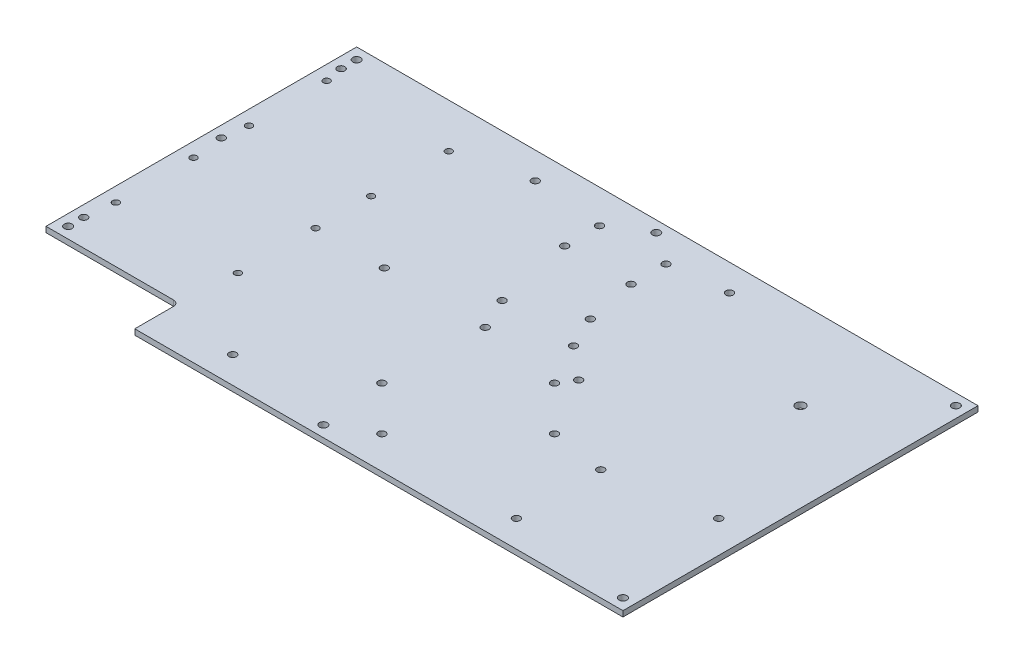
ISO-10303-21;
HEADER;
FILE_DESCRIPTION(('STEP AP214'),'2;1');
FILE_NAME('part.step','',(''),(''),'','','');
FILE_SCHEMA(('AUTOMOTIVE_DESIGN { 1 0 10303 214 1 1 1 1 }'));
ENDSEC;
DATA;
#1=APPLICATION_CONTEXT('core data for automotive mechanical design processes');
#2=APPLICATION_PROTOCOL_DEFINITION('international standard','automotive_design',2000,#1);
#3=PRODUCT_CONTEXT('',#1,'mechanical');
#4=PRODUCT('Part','Part','',(#3));
#5=PRODUCT_RELATED_PRODUCT_CATEGORY('part','',(#4));
#6=PRODUCT_DEFINITION_FORMATION('','',#4);
#7=PRODUCT_DEFINITION_CONTEXT('part definition',#1,'design');
#8=PRODUCT_DEFINITION('design','',#6,#7);
#9=PRODUCT_DEFINITION_SHAPE('','',#8);
#10=(LENGTH_UNIT() NAMED_UNIT(*) SI_UNIT(.MILLI.,.METRE.));
#11=(NAMED_UNIT(*) PLANE_ANGLE_UNIT() SI_UNIT($,.RADIAN.));
#12=(NAMED_UNIT(*) SI_UNIT($,.STERADIAN.) SOLID_ANGLE_UNIT());
#13=UNCERTAINTY_MEASURE_WITH_UNIT(LENGTH_MEASURE(1.E-05),#10,'distance_accuracy_value','');
#14=(GEOMETRIC_REPRESENTATION_CONTEXT(3) GLOBAL_UNCERTAINTY_ASSIGNED_CONTEXT((#13)) GLOBAL_UNIT_ASSIGNED_CONTEXT((#10,
#11,#12)) REPRESENTATION_CONTEXT('',''));
#15=CARTESIAN_POINT('',(0.,0.,0.));
#16=DIRECTION('',(0.,0.,1.));
#17=DIRECTION('',(1.,0.,0.));
#18=AXIS2_PLACEMENT_3D('',#15,#16,#17);
#19=CARTESIAN_POINT('',(0.,0.,0.));
#20=DIRECTION('',(0.,-1.,0.));
#21=DIRECTION('',(0.,0.,-1.));
#22=AXIS2_PLACEMENT_3D('',#19,#20,#21);
#23=PLANE('',#22);
#24=DIRECTION('',(-1.,0.,0.));
#25=VECTOR('',#24,1.);
#26=CARTESIAN_POINT('',(-16.0799648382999,0.,-25.4));
#27=LINE('',#26,#25);
#28=CARTESIAN_POINT('',(73.025,0.,-25.4));
#29=VERTEX_POINT('',#28);
#30=CARTESIAN_POINT('',(0.,0.,-25.4));
#31=VERTEX_POINT('',#30);
#32=EDGE_CURVE('E107',#29,#31,#27,.T.);
#33=ORIENTED_EDGE('',*,*,#32,.T.);
#34=DIRECTION('',(0.,0.,1.));
#35=VECTOR('',#34,1.);
#36=CARTESIAN_POINT('',(0.,0.,0.));
#37=LINE('',#36,#35);
#38=CARTESIAN_POINT('',(0.,0.,-203.2));
#39=VERTEX_POINT('',#38);
#40=EDGE_CURVE('E360',#39,#31,#37,.T.);
#41=ORIENTED_EDGE('',*,*,#40,.F.);
#42=DIRECTION('',(-1.,0.,0.));
#43=VECTOR('',#42,1.);
#44=CARTESIAN_POINT('',(0.,0.,-203.2));
#45=LINE('',#44,#43);
#46=CARTESIAN_POINT('',(355.6,0.,-203.2));
#47=VERTEX_POINT('',#46);
#48=EDGE_CURVE('E73',#47,#39,#45,.T.);
#49=ORIENTED_EDGE('',*,*,#48,.F.);
#50=DIRECTION('',(0.,0.,-1.));
#51=VECTOR('',#50,1.);
#52=CARTESIAN_POINT('',(355.6,0.,0.));
#53=LINE('',#52,#51);
#54=CARTESIAN_POINT('',(355.6,0.,0.));
#55=VERTEX_POINT('',#54);
#56=EDGE_CURVE('E371',#55,#47,#53,.T.);
#57=ORIENTED_EDGE('',*,*,#56,.F.);
#58=DIRECTION('',(1.,0.,0.));
#59=VECTOR('',#58,1.);
#60=CARTESIAN_POINT('',(0.,0.,0.));
#61=LINE('',#60,#59);
#62=CARTESIAN_POINT('',(76.2,0.,0.));
#63=VERTEX_POINT('',#62);
#64=EDGE_CURVE('E119',#63,#55,#61,.T.);
#65=ORIENTED_EDGE('',*,*,#64,.F.);
#66=DIRECTION('',(0.,0.,-1.));
#67=VECTOR('',#66,1.);
#68=CARTESIAN_POINT('',(76.2,0.,-22.225));
#69=LINE('',#68,#67);
#70=CARTESIAN_POINT('',(76.2,0.,-22.225));
#71=VERTEX_POINT('',#70);
#72=EDGE_CURVE('E102',#63,#71,#69,.T.);
#73=ORIENTED_EDGE('',*,*,#72,.T.);
#74=CARTESIAN_POINT('',(73.025,0.,-22.225));
#75=DIRECTION('',(0.,1.,0.));
#76=DIRECTION('',(0.,0.,-1.));
#77=AXIS2_PLACEMENT_3D('',#74,#75,#76);
#78=CIRCLE('',#77,3.175);
#79=EDGE_CURVE('E110',#71,#29,#78,.T.);
#80=ORIENTED_EDGE('',*,*,#79,.T.);
#81=EDGE_LOOP('',(#33,#41,#49,#57,#65,#73,#80));
#82=FACE_BOUND('',#81,.T.);
#83=CARTESIAN_POINT('',(304.8,0.,-152.4));
#84=DIRECTION('',(0.,1.,0.));
#85=DIRECTION('',(0.,0.,1.));
#86=AXIS2_PLACEMENT_3D('',#83,#84,#85);
#87=CIRCLE('',#86,2.70510000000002);
#88=CARTESIAN_POINT('',(304.8,0.,-149.6949));
#89=VERTEX_POINT('',#88);
#90=EDGE_CURVE('E135',#89,#89,#87,.T.);
#91=ORIENTED_EDGE('',*,*,#90,.T.);
#92=EDGE_LOOP('',(#91));
#93=FACE_BOUND('',#92,.T.);
#94=CARTESIAN_POINT('',(158.144890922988,0.,-164.06281126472));
#95=DIRECTION('',(0.,1.,0.));
#96=DIRECTION('',(0.,0.,1.));
#97=AXIS2_PLACEMENT_3D('',#94,#95,#96);
#98=CIRCLE('',#97,2.1082);
#99=CARTESIAN_POINT('',(158.144890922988,0.,-161.95461126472));
#100=VERTEX_POINT('',#99);
#101=EDGE_CURVE('E141',#100,#100,#98,.T.);
#102=ORIENTED_EDGE('',*,*,#101,.T.);
#103=EDGE_LOOP('',(#102));
#104=FACE_BOUND('',#103,.T.);
#105=CARTESIAN_POINT('',(158.117742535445,0.,-184.062792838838));
#106=DIRECTION('',(0.,1.,0.));
#107=DIRECTION('',(0.,0.,1.));
#108=AXIS2_PLACEMENT_3D('',#105,#106,#107);
#109=CIRCLE('',#108,2.1082);
#110=CARTESIAN_POINT('',(158.117742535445,0.,-181.954592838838));
#111=VERTEX_POINT('',#110);
#112=EDGE_CURVE('E147',#111,#111,#109,.T.);
#113=ORIENTED_EDGE('',*,*,#112,.T.);
#114=EDGE_LOOP('',(#113));
#115=FACE_BOUND('',#114,.T.);
#116=CARTESIAN_POINT('',(196.117707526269,0.,-184.114374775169));
#117=DIRECTION('',(0.,1.,0.));
#118=DIRECTION('',(0.,0.,1.));
#119=AXIS2_PLACEMENT_3D('',#116,#117,#118);
#120=CIRCLE('',#119,2.1082);
#121=CARTESIAN_POINT('',(196.117707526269,0.,-182.006174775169));
#122=VERTEX_POINT('',#121);
#123=EDGE_CURVE('E153',#122,#122,#120,.T.);
#124=ORIENTED_EDGE('',*,*,#123,.T.);
#125=EDGE_LOOP('',(#124));
#126=FACE_BOUND('',#125,.T.);
#127=CARTESIAN_POINT('',(196.144855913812,0.,-164.114393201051));
#128=DIRECTION('',(0.,1.,0.));
#129=DIRECTION('',(0.,0.,1.));
#130=AXIS2_PLACEMENT_3D('',#127,#128,#129);
#131=CIRCLE('',#130,2.1082);
#132=CARTESIAN_POINT('',(196.144855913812,0.,-162.006193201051));
#133=VERTEX_POINT('',#132);
#134=EDGE_CURVE('E159',#133,#133,#131,.T.);
#135=ORIENTED_EDGE('',*,*,#134,.T.);
#136=EDGE_LOOP('',(#135));
#137=FACE_BOUND('',#136,.T.);
#138=CARTESIAN_POINT('',(167.302257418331,0.,-119.108761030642));
#139=DIRECTION('',(0.,1.,0.));
#140=DIRECTION('',(0.,0.,1.));
#141=AXIS2_PLACEMENT_3D('',#138,#139,#140);
#142=CIRCLE('',#141,2.1082);
#143=CARTESIAN_POINT('',(167.302257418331,0.,-117.000561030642));
#144=VERTEX_POINT('',#143);
#145=EDGE_CURVE('E165',#144,#144,#142,.T.);
#146=ORIENTED_EDGE('',*,*,#145,.T.);
#147=EDGE_LOOP('',(#146));
#148=FACE_BOUND('',#147,.T.);
#149=CARTESIAN_POINT('',(175.779219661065,0.,-100.994095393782));
#150=DIRECTION('',(0.,1.,0.));
#151=DIRECTION('',(0.,0.,1.));
#152=AXIS2_PLACEMENT_3D('',#149,#150,#151);
#153=CIRCLE('',#152,2.1082);
#154=CARTESIAN_POINT('',(175.779219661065,0.,-98.8858953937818));
#155=VERTEX_POINT('',#154);
#156=EDGE_CURVE('E171',#155,#155,#153,.T.);
#157=ORIENTED_EDGE('',*,*,#156,.T.);
#158=EDGE_LOOP('',(#157));
#159=FACE_BOUND('',#158,.T.);
#160=CARTESIAN_POINT('',(210.1970843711,0.,-117.100323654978));
#161=DIRECTION('',(0.,1.,0.));
#162=DIRECTION('',(0.,0.,1.));
#163=AXIS2_PLACEMENT_3D('',#160,#161,#162);
#164=CIRCLE('',#163,2.1082);
#165=CARTESIAN_POINT('',(210.1970843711,0.,-114.992123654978));
#166=VERTEX_POINT('',#165);
#167=EDGE_CURVE('E177',#166,#166,#164,.T.);
#168=ORIENTED_EDGE('',*,*,#167,.T.);
#169=EDGE_LOOP('',(#168));
#170=FACE_BOUND('',#169,.T.);
#171=CARTESIAN_POINT('',(201.720122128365,0.,-135.214989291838));
#172=DIRECTION('',(0.,1.,0.));
#173=DIRECTION('',(0.,0.,1.));
#174=AXIS2_PLACEMENT_3D('',#171,#172,#173);
#175=CIRCLE('',#174,2.1082);
#176=CARTESIAN_POINT('',(201.720122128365,0.,-133.106789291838));
#177=VERTEX_POINT('',#176);
#178=EDGE_CURVE('E183',#177,#177,#175,.T.);
#179=ORIENTED_EDGE('',*,*,#178,.T.);
#180=EDGE_LOOP('',(#179));
#181=FACE_BOUND('',#180,.T.);
#182=CARTESIAN_POINT('',(6.35,0.,-187.96));
#183=DIRECTION('',(0.,1.,0.));
#184=DIRECTION('',(0.,0.,1.));
#185=AXIS2_PLACEMENT_3D('',#182,#183,#184);
#186=CIRCLE('',#185,2.1082);
#187=CARTESIAN_POINT('',(6.35,0.,-185.8518));
#188=VERTEX_POINT('',#187);
#189=EDGE_CURVE('E189',#188,#188,#186,.T.);
#190=ORIENTED_EDGE('',*,*,#189,.T.);
#191=EDGE_LOOP('',(#190));
#192=FACE_BOUND('',#191,.T.);
#193=CARTESIAN_POINT('',(6.35000000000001,0.,-119.38));
#194=DIRECTION('',(0.,1.,0.));
#195=DIRECTION('',(0.,0.,1.));
#196=AXIS2_PLACEMENT_3D('',#193,#194,#195);
#197=CIRCLE('',#196,2.1082);
#198=CARTESIAN_POINT('',(6.35000000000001,0.,-117.2718));
#199=VERTEX_POINT('',#198);
#200=EDGE_CURVE('E195',#199,#199,#197,.T.);
#201=ORIENTED_EDGE('',*,*,#200,.T.);
#202=EDGE_LOOP('',(#201));
#203=FACE_BOUND('',#202,.T.);
#204=CARTESIAN_POINT('',(6.35000000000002,0.,-40.64));
#205=DIRECTION('',(0.,1.,0.));
#206=DIRECTION('',(0.,0.,1.));
#207=AXIS2_PLACEMENT_3D('',#204,#205,#206);
#208=CIRCLE('',#207,2.1082);
#209=CARTESIAN_POINT('',(6.35000000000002,0.,-38.5318));
#210=VERTEX_POINT('',#209);
#211=EDGE_CURVE('E201',#210,#210,#208,.T.);
#212=ORIENTED_EDGE('',*,*,#211,.T.);
#213=EDGE_LOOP('',(#212));
#214=FACE_BOUND('',#213,.T.);
#215=CARTESIAN_POINT('',(117.018728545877,0.,-15.24));
#216=DIRECTION('',(0.,1.,0.));
#217=DIRECTION('',(0.,0.,1.));
#218=AXIS2_PLACEMENT_3D('',#215,#216,#217);
#219=CIRCLE('',#218,2.10819999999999);
#220=CARTESIAN_POINT('',(117.018728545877,0.,-13.1318));
#221=VERTEX_POINT('',#220);
#222=EDGE_CURVE('E207',#221,#221,#219,.T.);
#223=ORIENTED_EDGE('',*,*,#222,.T.);
#224=EDGE_LOOP('',(#223));
#225=FACE_BOUND('',#224,.T.);
#226=CARTESIAN_POINT('',(117.475,0.,-101.6));
#227=DIRECTION('',(0.,1.,0.));
#228=DIRECTION('',(0.,0.,1.));
#229=AXIS2_PLACEMENT_3D('',#226,#227,#228);
#230=CIRCLE('',#229,2.10819999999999);
#231=CARTESIAN_POINT('',(117.475,0.,-99.4918));
#232=VERTEX_POINT('',#231);
#233=EDGE_CURVE('E213',#232,#232,#230,.T.);
#234=ORIENTED_EDGE('',*,*,#233,.T.);
#235=EDGE_LOOP('',(#234));
#236=FACE_BOUND('',#235,.T.);
#237=CARTESIAN_POINT('',(117.475,0.,-187.96));
#238=DIRECTION('',(0.,1.,0.));
#239=DIRECTION('',(0.,0.,1.));
#240=AXIS2_PLACEMENT_3D('',#237,#238,#239);
#241=CIRCLE('',#240,2.10819999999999);
#242=CARTESIAN_POINT('',(117.475,0.,-185.8518));
#243=VERTEX_POINT('',#242);
#244=EDGE_CURVE('E219',#243,#243,#241,.T.);
#245=ORIENTED_EDGE('',*,*,#244,.T.);
#246=EDGE_LOOP('',(#245));
#247=FACE_BOUND('',#246,.T.);
#248=CARTESIAN_POINT('',(228.6,0.,-187.96));
#249=DIRECTION('',(0.,1.,0.));
#250=DIRECTION('',(0.,0.,1.));
#251=AXIS2_PLACEMENT_3D('',#248,#249,#250);
#252=CIRCLE('',#251,2.1082);
#253=CARTESIAN_POINT('',(228.6,0.,-185.8518));
#254=VERTEX_POINT('',#253);
#255=EDGE_CURVE('E225',#254,#254,#252,.T.);
#256=ORIENTED_EDGE('',*,*,#255,.T.);
#257=EDGE_LOOP('',(#256));
#258=FACE_BOUND('',#257,.T.);
#259=CARTESIAN_POINT('',(228.6,0.,-101.6));
#260=DIRECTION('',(0.,1.,0.));
#261=DIRECTION('',(0.,0.,1.));
#262=AXIS2_PLACEMENT_3D('',#259,#260,#261);
#263=CIRCLE('',#262,2.1082);
#264=CARTESIAN_POINT('',(228.6,0.,-99.4918));
#265=VERTEX_POINT('',#264);
#266=EDGE_CURVE('E231',#265,#265,#263,.T.);
#267=ORIENTED_EDGE('',*,*,#266,.T.);
#268=EDGE_LOOP('',(#267));
#269=FACE_BOUND('',#268,.T.);
#270=CARTESIAN_POINT('',(279.4,0.,-63.5));
#271=DIRECTION('',(0.,1.,0.));
#272=DIRECTION('',(0.,0.,1.));
#273=AXIS2_PLACEMENT_3D('',#270,#271,#272);
#274=CIRCLE('',#273,2.1082);
#275=CARTESIAN_POINT('',(279.4,0.,-61.3918));
#276=VERTEX_POINT('',#275);
#277=EDGE_CURVE('E237',#276,#276,#274,.T.);
#278=ORIENTED_EDGE('',*,*,#277,.T.);
#279=EDGE_LOOP('',(#278));
#280=FACE_BOUND('',#279,.T.);
#281=CARTESIAN_POINT('',(6.35000000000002,0.,-31.75));
#282=DIRECTION('',(0.,1.,0.));
#283=DIRECTION('',(0.,0.,1.));
#284=AXIS2_PLACEMENT_3D('',#281,#282,#283);
#285=CIRCLE('',#284,2.2479);
#286=CARTESIAN_POINT('',(6.35000000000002,0.,-29.5021));
#287=VERTEX_POINT('',#286);
#288=EDGE_CURVE('E357',#287,#287,#285,.T.);
#289=ORIENTED_EDGE('',*,*,#288,.T.);
#290=EDGE_LOOP('',(#289));
#291=FACE_BOUND('',#290,.T.);
#292=CARTESIAN_POINT('',(177.8,0.,-6.34999999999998));
#293=DIRECTION('',(0.,1.,0.));
#294=DIRECTION('',(0.,0.,1.));
#295=AXIS2_PLACEMENT_3D('',#292,#293,#294);
#296=CIRCLE('',#295,2.2479);
#297=CARTESIAN_POINT('',(177.8,0.,-4.10209999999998));
#298=VERTEX_POINT('',#297);
#299=EDGE_CURVE('E351',#298,#298,#296,.T.);
#300=ORIENTED_EDGE('',*,*,#299,.T.);
#301=EDGE_LOOP('',(#300));
#302=FACE_BOUND('',#301,.T.);
#303=CARTESIAN_POINT('',(349.25,0.,-6.35));
#304=DIRECTION('',(0.,1.,0.));
#305=DIRECTION('',(0.,0.,1.));
#306=AXIS2_PLACEMENT_3D('',#303,#304,#305);
#307=CIRCLE('',#306,2.24789999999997);
#308=CARTESIAN_POINT('',(349.25,0.,-4.10210000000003));
#309=VERTEX_POINT('',#308);
#310=EDGE_CURVE('E345',#309,#309,#307,.T.);
#311=ORIENTED_EDGE('',*,*,#310,.T.);
#312=EDGE_LOOP('',(#311));
#313=FACE_BOUND('',#312,.T.);
#314=CARTESIAN_POINT('',(349.25,0.,-196.85));
#315=DIRECTION('',(0.,1.,0.));
#316=DIRECTION('',(0.,0.,1.));
#317=AXIS2_PLACEMENT_3D('',#314,#315,#316);
#318=CIRCLE('',#317,2.24789999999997);
#319=CARTESIAN_POINT('',(349.25,0.,-194.6021));
#320=VERTEX_POINT('',#319);
#321=EDGE_CURVE('E339',#320,#320,#318,.T.);
#322=ORIENTED_EDGE('',*,*,#321,.T.);
#323=EDGE_LOOP('',(#322));
#324=FACE_BOUND('',#323,.T.);
#325=CARTESIAN_POINT('',(177.8,0.,-196.85));
#326=DIRECTION('',(0.,1.,0.));
#327=DIRECTION('',(0.,0.,1.));
#328=AXIS2_PLACEMENT_3D('',#325,#326,#327);
#329=CIRCLE('',#328,2.2479);
#330=CARTESIAN_POINT('',(177.8,0.,-194.6021));
#331=VERTEX_POINT('',#330);
#332=EDGE_CURVE('E333',#331,#331,#329,.T.);
#333=ORIENTED_EDGE('',*,*,#332,.T.);
#334=EDGE_LOOP('',(#333));
#335=FACE_BOUND('',#334,.T.);
#336=CARTESIAN_POINT('',(6.35,0.,-196.85));
#337=DIRECTION('',(0.,1.,0.));
#338=DIRECTION('',(0.,0.,1.));
#339=AXIS2_PLACEMENT_3D('',#336,#337,#338);
#340=CIRCLE('',#339,2.2479);
#341=CARTESIAN_POINT('',(6.35,0.,-194.6021));
#342=VERTEX_POINT('',#341);
#343=EDGE_CURVE('E327',#342,#342,#340,.T.);
#344=ORIENTED_EDGE('',*,*,#343,.T.);
#345=EDGE_LOOP('',(#344));
#346=FACE_BOUND('',#345,.T.);
#347=CARTESIAN_POINT('',(8.20480615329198,0.,-177.818273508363));
#348=DIRECTION('',(0.,-1.,0.));
#349=DIRECTION('',(0.,0.,-1.));
#350=AXIS2_PLACEMENT_3D('',#347,#348,#349);
#351=CIRCLE('',#350,1.89865);
#352=CARTESIAN_POINT('',(8.20480615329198,0.,-179.716923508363));
#353=VERTEX_POINT('',#352);
#354=EDGE_CURVE('E318',#353,#353,#351,.T.);
#355=ORIENTED_EDGE('',*,*,#354,.F.);
#356=EDGE_LOOP('',(#355));
#357=FACE_BOUND('',#356,.T.);
#358=CARTESIAN_POINT('',(78.054806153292,0.,-177.818273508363));
#359=DIRECTION('',(0.,-1.,0.));
#360=DIRECTION('',(0.,0.,-1.));
#361=AXIS2_PLACEMENT_3D('',#358,#359,#360);
#362=CIRCLE('',#361,1.89865);
#363=CARTESIAN_POINT('',(78.054806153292,0.,-179.716923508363));
#364=VERTEX_POINT('',#363);
#365=EDGE_CURVE('E312',#364,#364,#362,.T.);
#366=ORIENTED_EDGE('',*,*,#365,.F.);
#367=EDGE_LOOP('',(#366));
#368=FACE_BOUND('',#367,.T.);
#369=CARTESIAN_POINT('',(78.054806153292,0.,-133.368273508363));
#370=DIRECTION('',(0.,-1.,0.));
#371=DIRECTION('',(0.,0.,-1.));
#372=AXIS2_PLACEMENT_3D('',#369,#370,#371);
#373=CIRCLE('',#372,1.89865);
#374=CARTESIAN_POINT('',(78.054806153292,0.,-135.266923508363));
#375=VERTEX_POINT('',#374);
#376=EDGE_CURVE('E306',#375,#375,#373,.T.);
#377=ORIENTED_EDGE('',*,*,#376,.F.);
#378=EDGE_LOOP('',(#377));
#379=FACE_BOUND('',#378,.T.);
#380=CARTESIAN_POINT('',(8.20480615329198,0.,-133.368273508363));
#381=DIRECTION('',(0.,-1.,0.));
#382=DIRECTION('',(0.,0.,-1.));
#383=AXIS2_PLACEMENT_3D('',#380,#381,#382);
#384=CIRCLE('',#383,1.89865);
#385=CARTESIAN_POINT('',(8.20480615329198,0.,-135.266923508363));
#386=VERTEX_POINT('',#385);
#387=EDGE_CURVE('E300',#386,#386,#384,.T.);
#388=ORIENTED_EDGE('',*,*,#387,.F.);
#389=EDGE_LOOP('',(#388));
#390=FACE_BOUND('',#389,.T.);
#391=CARTESIAN_POINT('',(78.054806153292,0.,-57.1682735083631));
#392=DIRECTION('',(0.,-1.,0.));
#393=DIRECTION('',(0.,0.,-1.));
#394=AXIS2_PLACEMENT_3D('',#391,#392,#393);
#395=CIRCLE('',#394,1.89865);
#396=CARTESIAN_POINT('',(78.054806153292,0.,-59.0669235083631));
#397=VERTEX_POINT('',#396);
#398=EDGE_CURVE('E294',#397,#397,#395,.T.);
#399=ORIENTED_EDGE('',*,*,#398,.F.);
#400=EDGE_LOOP('',(#399));
#401=FACE_BOUND('',#400,.T.);
#402=CARTESIAN_POINT('',(78.054806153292,0.,-101.618273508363));
#403=DIRECTION('',(0.,-1.,0.));
#404=DIRECTION('',(0.,0.,-1.));
#405=AXIS2_PLACEMENT_3D('',#402,#403,#404);
#406=CIRCLE('',#405,1.89865);
#407=CARTESIAN_POINT('',(78.054806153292,0.,-103.516923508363));
#408=VERTEX_POINT('',#407);
#409=EDGE_CURVE('E288',#408,#408,#406,.T.);
#410=ORIENTED_EDGE('',*,*,#409,.F.);
#411=EDGE_LOOP('',(#410));
#412=FACE_BOUND('',#411,.T.);
#413=CARTESIAN_POINT('',(8.20480615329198,0.,-101.618273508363));
#414=DIRECTION('',(0.,-1.,0.));
#415=DIRECTION('',(0.,0.,-1.));
#416=AXIS2_PLACEMENT_3D('',#413,#414,#415);
#417=CIRCLE('',#416,1.89865);
#418=CARTESIAN_POINT('',(8.20480615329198,0.,-103.516923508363));
#419=VERTEX_POINT('',#418);
#420=EDGE_CURVE('E282',#419,#419,#417,.T.);
#421=ORIENTED_EDGE('',*,*,#420,.F.);
#422=EDGE_LOOP('',(#421));
#423=FACE_BOUND('',#422,.T.);
#424=CARTESIAN_POINT('',(8.20480615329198,0.,-57.1682735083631));
#425=DIRECTION('',(0.,-1.,0.));
#426=DIRECTION('',(0.,0.,-1.));
#427=AXIS2_PLACEMENT_3D('',#424,#425,#426);
#428=CIRCLE('',#427,1.89865);
#429=CARTESIAN_POINT('',(8.20480615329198,0.,-59.0669235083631));
#430=VERTEX_POINT('',#429);
#431=EDGE_CURVE('E276',#430,#430,#428,.T.);
#432=ORIENTED_EDGE('',*,*,#431,.F.);
#433=EDGE_LOOP('',(#432));
#434=FACE_BOUND('',#433,.T.);
#435=CARTESIAN_POINT('',(337.269144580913,0.,-73.1366321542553));
#436=DIRECTION('',(0.,1.,0.));
#437=DIRECTION('',(0.,0.,1.));
#438=AXIS2_PLACEMENT_3D('',#435,#436,#437);
#439=CIRCLE('',#438,2.1082);
#440=CARTESIAN_POINT('',(337.269144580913,0.,-71.0284321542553));
#441=VERTEX_POINT('',#440);
#442=EDGE_CURVE('E273',#441,#441,#439,.T.);
#443=ORIENTED_EDGE('',*,*,#442,.T.);
#444=EDGE_LOOP('',(#443));
#445=FACE_BOUND('',#444,.T.);
#446=CARTESIAN_POINT('',(198.969276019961,0.,-18.652330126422));
#447=DIRECTION('',(0.,1.,0.));
#448=DIRECTION('',(0.,0.,1.));
#449=AXIS2_PLACEMENT_3D('',#446,#447,#448);
#450=CIRCLE('',#449,2.1082);
#451=CARTESIAN_POINT('',(198.969276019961,0.,-16.544130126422));
#452=VERTEX_POINT('',#451);
#453=EDGE_CURVE('E267',#452,#452,#450,.T.);
#454=ORIENTED_EDGE('',*,*,#453,.T.);
#455=EDGE_LOOP('',(#454));
#456=FACE_BOUND('',#455,.T.);
#457=CARTESIAN_POINT('',(248.360684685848,0.,-68.043738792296));
#458=DIRECTION('',(0.,1.,0.));
#459=DIRECTION('',(0.,0.,1.));
#460=AXIS2_PLACEMENT_3D('',#457,#458,#459);
#461=CIRCLE('',#460,2.1082);
#462=CARTESIAN_POINT('',(248.360684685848,0.,-65.935538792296));
#463=VERTEX_POINT('',#462);
#464=EDGE_CURVE('E261',#463,#463,#461,.T.);
#465=ORIENTED_EDGE('',*,*,#464,.T.);
#466=EDGE_LOOP('',(#465));
#467=FACE_BOUND('',#466,.T.);
#468=CARTESIAN_POINT('',(223.215967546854,0.,-93.1884559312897));
#469=DIRECTION('',(0.,1.,0.));
#470=DIRECTION('',(0.,0.,1.));
#471=AXIS2_PLACEMENT_3D('',#468,#469,#470);
#472=CIRCLE('',#471,2.1082);
#473=CARTESIAN_POINT('',(223.215967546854,0.,-91.0802559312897));
#474=VERTEX_POINT('',#473);
#475=EDGE_CURVE('E255',#474,#474,#472,.T.);
#476=ORIENTED_EDGE('',*,*,#475,.T.);
#477=EDGE_LOOP('',(#476));
#478=FACE_BOUND('',#477,.T.);
#479=CARTESIAN_POINT('',(173.824558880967,0.,-43.7970472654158));
#480=DIRECTION('',(0.,1.,0.));
#481=DIRECTION('',(0.,0.,1.));
#482=AXIS2_PLACEMENT_3D('',#479,#480,#481);
#483=CIRCLE('',#482,2.1082);
#484=CARTESIAN_POINT('',(173.824558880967,0.,-41.6888472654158));
#485=VERTEX_POINT('',#484);
#486=EDGE_CURVE('E249',#485,#485,#483,.T.);
#487=ORIENTED_EDGE('',*,*,#486,.T.);
#488=EDGE_LOOP('',(#487));
#489=FACE_BOUND('',#488,.T.);
#490=CARTESIAN_POINT('',(279.4,0.,-15.24));
#491=DIRECTION('',(0.,1.,0.));
#492=DIRECTION('',(0.,0.,1.));
#493=AXIS2_PLACEMENT_3D('',#490,#491,#492);
#494=CIRCLE('',#493,2.1082);
#495=CARTESIAN_POINT('',(279.4,0.,-13.1318));
#496=VERTEX_POINT('',#495);
#497=EDGE_CURVE('E243',#496,#496,#494,.T.);
#498=ORIENTED_EDGE('',*,*,#497,.T.);
#499=EDGE_LOOP('',(#498));
#500=FACE_BOUND('',#499,.T.);
#501=ADVANCED_FACE('F33',(#82,#93,#104,#115,#126,#137,#148,#159,#170,#181,#192,#203,#214,#225,
#236,#247,#258,#269,#280,#291,#302,#313,#324,#335,#346,#357,#368,#379,#390,#401,#412,#423,#434,
#445,#456,#467,#478,#489,#500),#23,.T.);
#502=CARTESIAN_POINT('',(0.,3.175,0.));
#503=DIRECTION('',(1.,0.,0.));
#504=DIRECTION('',(0.,0.,-1.));
#505=AXIS2_PLACEMENT_3D('',#502,#503,#504);
#506=PLANE('',#505);
#507=ORIENTED_EDGE('',*,*,#40,.T.);
#508=DIRECTION('',(0.,1.,0.));
#509=VECTOR('',#508,1.);
#510=CARTESIAN_POINT('',(0.,3.175,-25.4));
#511=LINE('',#510,#509);
#512=CARTESIAN_POINT('',(0.,3.175,-25.4));
#513=VERTEX_POINT('',#512);
#514=EDGE_CURVE('E129',#31,#513,#511,.T.);
#515=ORIENTED_EDGE('',*,*,#514,.T.);
#516=DIRECTION('',(0.,0.,1.));
#517=VECTOR('',#516,1.);
#518=CARTESIAN_POINT('',(0.,3.175,0.));
#519=LINE('',#518,#517);
#520=CARTESIAN_POINT('',(0.,3.175,-203.2));
#521=VERTEX_POINT('',#520);
#522=EDGE_CURVE('E361',#521,#513,#519,.T.);
#523=ORIENTED_EDGE('',*,*,#522,.F.);
#524=DIRECTION('',(0.,-1.,0.));
#525=VECTOR('',#524,1.);
#526=CARTESIAN_POINT('',(0.,3.175,-203.2));
#527=LINE('',#526,#525);
#528=EDGE_CURVE('E367',#521,#39,#527,.T.);
#529=ORIENTED_EDGE('',*,*,#528,.T.);
#530=EDGE_LOOP('',(#507,#515,#523,#529));
#531=FACE_BOUND('',#530,.T.);
#532=ADVANCED_FACE('F35',(#531),#506,.F.);
#533=CARTESIAN_POINT('',(0.,3.175,0.));
#534=DIRECTION('',(0.,0.,-1.));
#535=DIRECTION('',(-1.,0.,0.));
#536=AXIS2_PLACEMENT_3D('',#533,#534,#535);
#537=PLANE('',#536);
#538=DIRECTION('',(1.,0.,0.));
#539=VECTOR('',#538,1.);
#540=CARTESIAN_POINT('',(0.,3.175,0.));
#541=LINE('',#540,#539);
#542=CARTESIAN_POINT('',(76.2,3.175,0.));
#543=VERTEX_POINT('',#542);
#544=CARTESIAN_POINT('',(355.6,3.175,0.));
#545=VERTEX_POINT('',#544);
#546=EDGE_CURVE('E77',#543,#545,#541,.T.);
#547=ORIENTED_EDGE('',*,*,#546,.F.);
#548=DIRECTION('',(0.,-1.,0.));
#549=VECTOR('',#548,1.);
#550=CARTESIAN_POINT('',(76.2,3.175,0.));
#551=LINE('',#550,#549);
#552=EDGE_CURVE('E48',#543,#63,#551,.T.);
#553=ORIENTED_EDGE('',*,*,#552,.T.);
#554=ORIENTED_EDGE('',*,*,#64,.T.);
#555=DIRECTION('',(0.,-1.,0.));
#556=VECTOR('',#555,1.);
#557=CARTESIAN_POINT('',(355.6,3.175,0.));
#558=LINE('',#557,#556);
#559=EDGE_CURVE('E41',#545,#55,#558,.T.);
#560=ORIENTED_EDGE('',*,*,#559,.F.);
#561=EDGE_LOOP('',(#547,#553,#554,#560));
#562=FACE_BOUND('',#561,.T.);
#563=ADVANCED_FACE('F396',(#562),#537,.F.);
#564=CARTESIAN_POINT('',(355.6,3.175,0.));
#565=DIRECTION('',(-1.,0.,0.));
#566=DIRECTION('',(0.,0.,1.));
#567=AXIS2_PLACEMENT_3D('',#564,#565,#566);
#568=PLANE('',#567);
#569=ORIENTED_EDGE('',*,*,#56,.T.);
#570=DIRECTION('',(0.,-1.,0.));
#571=VECTOR('',#570,1.);
#572=CARTESIAN_POINT('',(355.6,3.175,-203.2));
#573=LINE('',#572,#571);
#574=CARTESIAN_POINT('',(355.6,3.175,-203.2));
#575=VERTEX_POINT('',#574);
#576=EDGE_CURVE('E375',#575,#47,#573,.T.);
#577=ORIENTED_EDGE('',*,*,#576,.F.);
#578=DIRECTION('',(0.,0.,-1.));
#579=VECTOR('',#578,1.);
#580=CARTESIAN_POINT('',(355.6,3.175,0.));
#581=LINE('',#580,#579);
#582=EDGE_CURVE('E364',#545,#575,#581,.T.);
#583=ORIENTED_EDGE('',*,*,#582,.F.);
#584=ORIENTED_EDGE('',*,*,#559,.T.);
#585=EDGE_LOOP('',(#569,#577,#583,#584));
#586=FACE_BOUND('',#585,.T.);
#587=ADVANCED_FACE('F379',(#586),#568,.F.);
#588=CARTESIAN_POINT('',(0.,3.175,-203.2));
#589=DIRECTION('',(0.,0.,1.));
#590=DIRECTION('',(1.,0.,0.));
#591=AXIS2_PLACEMENT_3D('',#588,#589,#590);
#592=PLANE('',#591);
#593=ORIENTED_EDGE('',*,*,#48,.T.);
#594=ORIENTED_EDGE('',*,*,#528,.F.);
#595=DIRECTION('',(-1.,0.,0.));
#596=VECTOR('',#595,1.);
#597=CARTESIAN_POINT('',(0.,3.175,-203.2));
#598=LINE('',#597,#596);
#599=EDGE_CURVE('E56',#575,#521,#598,.T.);
#600=ORIENTED_EDGE('',*,*,#599,.F.);
#601=ORIENTED_EDGE('',*,*,#576,.T.);
#602=EDGE_LOOP('',(#593,#594,#600,#601));
#603=FACE_BOUND('',#602,.T.);
#604=ADVANCED_FACE('F385',(#603),#592,.F.);
#605=CARTESIAN_POINT('',(0.,3.175,0.));
#606=DIRECTION('',(0.,-1.,0.));
#607=DIRECTION('',(0.,0.,-1.));
#608=AXIS2_PLACEMENT_3D('',#605,#606,#607);
#609=PLANE('',#608);
#610=CARTESIAN_POINT('',(304.8,3.175,-152.4));
#611=DIRECTION('',(0.,1.,0.));
#612=DIRECTION('',(0.,0.,1.));
#613=AXIS2_PLACEMENT_3D('',#610,#611,#612);
#614=CIRCLE('',#613,2.70510000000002);
#615=CARTESIAN_POINT('',(304.8,3.175,-149.6949));
#616=VERTEX_POINT('',#615);
#617=EDGE_CURVE('E132',#616,#616,#614,.T.);
#618=ORIENTED_EDGE('',*,*,#617,.F.);
#619=EDGE_LOOP('',(#618));
#620=FACE_BOUND('',#619,.T.);
#621=CARTESIAN_POINT('',(158.144890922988,3.175,-164.06281126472));
#622=DIRECTION('',(0.,1.,0.));
#623=DIRECTION('',(0.,0.,1.));
#624=AXIS2_PLACEMENT_3D('',#621,#622,#623);
#625=CIRCLE('',#624,2.10819999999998);
#626=CARTESIAN_POINT('',(158.144890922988,3.175,-161.95461126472));
#627=VERTEX_POINT('',#626);
#628=EDGE_CURVE('E138',#627,#627,#625,.T.);
#629=ORIENTED_EDGE('',*,*,#628,.F.);
#630=EDGE_LOOP('',(#629));
#631=FACE_BOUND('',#630,.T.);
#632=CARTESIAN_POINT('',(158.117742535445,3.175,-184.062792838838));
#633=DIRECTION('',(0.,1.,0.));
#634=DIRECTION('',(0.,0.,1.));
#635=AXIS2_PLACEMENT_3D('',#632,#633,#634);
#636=CIRCLE('',#635,2.10819999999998);
#637=CARTESIAN_POINT('',(158.117742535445,3.175,-181.954592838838));
#638=VERTEX_POINT('',#637);
#639=EDGE_CURVE('E144',#638,#638,#636,.T.);
#640=ORIENTED_EDGE('',*,*,#639,.F.);
#641=EDGE_LOOP('',(#640));
#642=FACE_BOUND('',#641,.T.);
#643=CARTESIAN_POINT('',(196.117707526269,3.175,-184.114374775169));
#644=DIRECTION('',(0.,1.,0.));
#645=DIRECTION('',(0.,0.,1.));
#646=AXIS2_PLACEMENT_3D('',#643,#644,#645);
#647=CIRCLE('',#646,2.10819999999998);
#648=CARTESIAN_POINT('',(196.117707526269,3.175,-182.006174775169));
#649=VERTEX_POINT('',#648);
#650=EDGE_CURVE('E150',#649,#649,#647,.T.);
#651=ORIENTED_EDGE('',*,*,#650,.F.);
#652=EDGE_LOOP('',(#651));
#653=FACE_BOUND('',#652,.T.);
#654=CARTESIAN_POINT('',(196.144855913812,3.175,-164.114393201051));
#655=DIRECTION('',(0.,1.,0.));
#656=DIRECTION('',(0.,0.,1.));
#657=AXIS2_PLACEMENT_3D('',#654,#655,#656);
#658=CIRCLE('',#657,2.10819999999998);
#659=CARTESIAN_POINT('',(196.144855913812,3.175,-162.006193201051));
#660=VERTEX_POINT('',#659);
#661=EDGE_CURVE('E156',#660,#660,#658,.T.);
#662=ORIENTED_EDGE('',*,*,#661,.F.);
#663=EDGE_LOOP('',(#662));
#664=FACE_BOUND('',#663,.T.);
#665=CARTESIAN_POINT('',(167.302257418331,3.175,-119.108761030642));
#666=DIRECTION('',(0.,1.,0.));
#667=DIRECTION('',(0.,0.,1.));
#668=AXIS2_PLACEMENT_3D('',#665,#666,#667);
#669=CIRCLE('',#668,2.10819999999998);
#670=CARTESIAN_POINT('',(167.302257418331,3.175,-117.000561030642));
#671=VERTEX_POINT('',#670);
#672=EDGE_CURVE('E162',#671,#671,#669,.T.);
#673=ORIENTED_EDGE('',*,*,#672,.F.);
#674=EDGE_LOOP('',(#673));
#675=FACE_BOUND('',#674,.T.);
#676=CARTESIAN_POINT('',(175.779219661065,3.175,-100.994095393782));
#677=DIRECTION('',(0.,1.,0.));
#678=DIRECTION('',(0.,0.,1.));
#679=AXIS2_PLACEMENT_3D('',#676,#677,#678);
#680=CIRCLE('',#679,2.10819999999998);
#681=CARTESIAN_POINT('',(175.779219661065,3.175,-98.8858953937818));
#682=VERTEX_POINT('',#681);
#683=EDGE_CURVE('E168',#682,#682,#680,.T.);
#684=ORIENTED_EDGE('',*,*,#683,.F.);
#685=EDGE_LOOP('',(#684));
#686=FACE_BOUND('',#685,.T.);
#687=CARTESIAN_POINT('',(210.1970843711,3.175,-117.100323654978));
#688=DIRECTION('',(0.,1.,0.));
#689=DIRECTION('',(0.,0.,1.));
#690=AXIS2_PLACEMENT_3D('',#687,#688,#689);
#691=CIRCLE('',#690,2.10819999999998);
#692=CARTESIAN_POINT('',(210.1970843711,3.175,-114.992123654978));
#693=VERTEX_POINT('',#692);
#694=EDGE_CURVE('E174',#693,#693,#691,.T.);
#695=ORIENTED_EDGE('',*,*,#694,.F.);
#696=EDGE_LOOP('',(#695));
#697=FACE_BOUND('',#696,.T.);
#698=CARTESIAN_POINT('',(201.720122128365,3.175,-135.214989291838));
#699=DIRECTION('',(0.,1.,0.));
#700=DIRECTION('',(0.,0.,1.));
#701=AXIS2_PLACEMENT_3D('',#698,#699,#700);
#702=CIRCLE('',#701,2.10819999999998);
#703=CARTESIAN_POINT('',(201.720122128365,3.175,-133.106789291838));
#704=VERTEX_POINT('',#703);
#705=EDGE_CURVE('E180',#704,#704,#702,.T.);
#706=ORIENTED_EDGE('',*,*,#705,.F.);
#707=EDGE_LOOP('',(#706));
#708=FACE_BOUND('',#707,.T.);
#709=CARTESIAN_POINT('',(6.35,3.175,-187.96));
#710=DIRECTION('',(0.,1.,0.));
#711=DIRECTION('',(0.,0.,1.));
#712=AXIS2_PLACEMENT_3D('',#709,#710,#711);
#713=CIRCLE('',#712,2.10819999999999);
#714=CARTESIAN_POINT('',(6.35,3.175,-185.8518));
#715=VERTEX_POINT('',#714);
#716=EDGE_CURVE('E186',#715,#715,#713,.T.);
#717=ORIENTED_EDGE('',*,*,#716,.F.);
#718=EDGE_LOOP('',(#717));
#719=FACE_BOUND('',#718,.T.);
#720=CARTESIAN_POINT('',(6.35000000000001,3.175,-119.38));
#721=DIRECTION('',(0.,1.,0.));
#722=DIRECTION('',(0.,0.,1.));
#723=AXIS2_PLACEMENT_3D('',#720,#721,#722);
#724=CIRCLE('',#723,2.10819999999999);
#725=CARTESIAN_POINT('',(6.35000000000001,3.175,-117.2718));
#726=VERTEX_POINT('',#725);
#727=EDGE_CURVE('E192',#726,#726,#724,.T.);
#728=ORIENTED_EDGE('',*,*,#727,.F.);
#729=EDGE_LOOP('',(#728));
#730=FACE_BOUND('',#729,.T.);
#731=CARTESIAN_POINT('',(6.35000000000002,3.175,-40.64));
#732=DIRECTION('',(0.,1.,0.));
#733=DIRECTION('',(0.,0.,1.));
#734=AXIS2_PLACEMENT_3D('',#731,#732,#733);
#735=CIRCLE('',#734,2.10819999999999);
#736=CARTESIAN_POINT('',(6.35000000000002,3.175,-38.5318));
#737=VERTEX_POINT('',#736);
#738=EDGE_CURVE('E198',#737,#737,#735,.T.);
#739=ORIENTED_EDGE('',*,*,#738,.F.);
#740=EDGE_LOOP('',(#739));
#741=FACE_BOUND('',#740,.T.);
#742=CARTESIAN_POINT('',(117.018728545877,3.175,-15.24));
#743=DIRECTION('',(0.,1.,0.));
#744=DIRECTION('',(0.,0.,1.));
#745=AXIS2_PLACEMENT_3D('',#742,#743,#744);
#746=CIRCLE('',#745,2.10819999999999);
#747=CARTESIAN_POINT('',(117.018728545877,3.175,-13.1318));
#748=VERTEX_POINT('',#747);
#749=EDGE_CURVE('E204',#748,#748,#746,.T.);
#750=ORIENTED_EDGE('',*,*,#749,.F.);
#751=EDGE_LOOP('',(#750));
#752=FACE_BOUND('',#751,.T.);
#753=CARTESIAN_POINT('',(117.475,3.175,-101.6));
#754=DIRECTION('',(0.,1.,0.));
#755=DIRECTION('',(0.,0.,1.));
#756=AXIS2_PLACEMENT_3D('',#753,#754,#755);
#757=CIRCLE('',#756,2.10819999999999);
#758=CARTESIAN_POINT('',(117.475,3.175,-99.4918));
#759=VERTEX_POINT('',#758);
#760=EDGE_CURVE('E210',#759,#759,#757,.T.);
#761=ORIENTED_EDGE('',*,*,#760,.F.);
#762=EDGE_LOOP('',(#761));
#763=FACE_BOUND('',#762,.T.);
#764=CARTESIAN_POINT('',(117.475,3.175,-187.96));
#765=DIRECTION('',(0.,1.,0.));
#766=DIRECTION('',(0.,0.,1.));
#767=AXIS2_PLACEMENT_3D('',#764,#765,#766);
#768=CIRCLE('',#767,2.10819999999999);
#769=CARTESIAN_POINT('',(117.475,3.175,-185.8518));
#770=VERTEX_POINT('',#769);
#771=EDGE_CURVE('E216',#770,#770,#768,.T.);
#772=ORIENTED_EDGE('',*,*,#771,.F.);
#773=EDGE_LOOP('',(#772));
#774=FACE_BOUND('',#773,.T.);
#775=CARTESIAN_POINT('',(228.6,3.175,-187.96));
#776=DIRECTION('',(0.,1.,0.));
#777=DIRECTION('',(0.,0.,1.));
#778=AXIS2_PLACEMENT_3D('',#775,#776,#777);
#779=CIRCLE('',#778,2.10819999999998);
#780=CARTESIAN_POINT('',(228.6,3.175,-185.8518));
#781=VERTEX_POINT('',#780);
#782=EDGE_CURVE('E222',#781,#781,#779,.T.);
#783=ORIENTED_EDGE('',*,*,#782,.F.);
#784=EDGE_LOOP('',(#783));
#785=FACE_BOUND('',#784,.T.);
#786=CARTESIAN_POINT('',(228.6,3.175,-101.6));
#787=DIRECTION('',(0.,1.,0.));
#788=DIRECTION('',(0.,0.,1.));
#789=AXIS2_PLACEMENT_3D('',#786,#787,#788);
#790=CIRCLE('',#789,2.10819999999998);
#791=CARTESIAN_POINT('',(228.6,3.175,-99.4918));
#792=VERTEX_POINT('',#791);
#793=EDGE_CURVE('E228',#792,#792,#790,.T.);
#794=ORIENTED_EDGE('',*,*,#793,.F.);
#795=EDGE_LOOP('',(#794));
#796=FACE_BOUND('',#795,.T.);
#797=CARTESIAN_POINT('',(279.4,3.175,-63.5));
#798=DIRECTION('',(0.,1.,0.));
#799=DIRECTION('',(0.,0.,1.));
#800=AXIS2_PLACEMENT_3D('',#797,#798,#799);
#801=CIRCLE('',#800,2.1082);
#802=CARTESIAN_POINT('',(279.4,3.175,-61.3918));
#803=VERTEX_POINT('',#802);
#804=EDGE_CURVE('E234',#803,#803,#801,.T.);
#805=ORIENTED_EDGE('',*,*,#804,.F.);
#806=EDGE_LOOP('',(#805));
#807=FACE_BOUND('',#806,.T.);
#808=CARTESIAN_POINT('',(279.4,3.175,-15.24));
#809=DIRECTION('',(0.,1.,0.));
#810=DIRECTION('',(0.,0.,1.));
#811=AXIS2_PLACEMENT_3D('',#808,#809,#810);
#812=CIRCLE('',#811,2.1082);
#813=CARTESIAN_POINT('',(279.4,3.175,-13.1318));
#814=VERTEX_POINT('',#813);
#815=EDGE_CURVE('E240',#814,#814,#812,.T.);
#816=ORIENTED_EDGE('',*,*,#815,.F.);
#817=EDGE_LOOP('',(#816));
#818=FACE_BOUND('',#817,.T.);
#819=CARTESIAN_POINT('',(173.824558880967,3.175,-43.7970472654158));
#820=DIRECTION('',(0.,1.,0.));
#821=DIRECTION('',(0.,0.,1.));
#822=AXIS2_PLACEMENT_3D('',#819,#820,#821);
#823=CIRCLE('',#822,2.1082);
#824=CARTESIAN_POINT('',(173.824558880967,3.175,-41.6888472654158));
#825=VERTEX_POINT('',#824);
#826=EDGE_CURVE('E246',#825,#825,#823,.T.);
#827=ORIENTED_EDGE('',*,*,#826,.F.);
#828=EDGE_LOOP('',(#827));
#829=FACE_BOUND('',#828,.T.);
#830=CARTESIAN_POINT('',(223.215967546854,3.175,-93.1884559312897));
#831=DIRECTION('',(0.,1.,0.));
#832=DIRECTION('',(0.,0.,1.));
#833=AXIS2_PLACEMENT_3D('',#830,#831,#832);
#834=CIRCLE('',#833,2.1082);
#835=CARTESIAN_POINT('',(223.215967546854,3.175,-91.0802559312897));
#836=VERTEX_POINT('',#835);
#837=EDGE_CURVE('E252',#836,#836,#834,.T.);
#838=ORIENTED_EDGE('',*,*,#837,.F.);
#839=EDGE_LOOP('',(#838));
#840=FACE_BOUND('',#839,.T.);
#841=CARTESIAN_POINT('',(248.360684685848,3.175,-68.043738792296));
#842=DIRECTION('',(0.,1.,0.));
#843=DIRECTION('',(0.,0.,1.));
#844=AXIS2_PLACEMENT_3D('',#841,#842,#843);
#845=CIRCLE('',#844,2.1082);
#846=CARTESIAN_POINT('',(248.360684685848,3.175,-65.935538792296));
#847=VERTEX_POINT('',#846);
#848=EDGE_CURVE('E258',#847,#847,#845,.T.);
#849=ORIENTED_EDGE('',*,*,#848,.F.);
#850=EDGE_LOOP('',(#849));
#851=FACE_BOUND('',#850,.T.);
#852=CARTESIAN_POINT('',(198.969276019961,3.175,-18.652330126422));
#853=DIRECTION('',(0.,1.,0.));
#854=DIRECTION('',(0.,0.,1.));
#855=AXIS2_PLACEMENT_3D('',#852,#853,#854);
#856=CIRCLE('',#855,2.1082);
#857=CARTESIAN_POINT('',(198.969276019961,3.175,-16.544130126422));
#858=VERTEX_POINT('',#857);
#859=EDGE_CURVE('E264',#858,#858,#856,.T.);
#860=ORIENTED_EDGE('',*,*,#859,.F.);
#861=EDGE_LOOP('',(#860));
#862=FACE_BOUND('',#861,.T.);
#863=CARTESIAN_POINT('',(337.269144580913,3.175,-73.1366321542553));
#864=DIRECTION('',(0.,1.,0.));
#865=DIRECTION('',(0.,0.,1.));
#866=AXIS2_PLACEMENT_3D('',#863,#864,#865);
#867=CIRCLE('',#866,2.1082);
#868=CARTESIAN_POINT('',(337.269144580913,3.175,-71.0284321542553));
#869=VERTEX_POINT('',#868);
#870=EDGE_CURVE('E270',#869,#869,#867,.T.);
#871=ORIENTED_EDGE('',*,*,#870,.F.);
#872=EDGE_LOOP('',(#871));
#873=FACE_BOUND('',#872,.T.);
#874=CARTESIAN_POINT('',(8.20480615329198,3.175,-57.1682735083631));
#875=DIRECTION('',(0.,-1.,0.));
#876=DIRECTION('',(0.,0.,-1.));
#877=AXIS2_PLACEMENT_3D('',#874,#875,#876);
#878=CIRCLE('',#877,1.89865);
#879=CARTESIAN_POINT('',(8.20480615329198,3.175,-59.0669235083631));
#880=VERTEX_POINT('',#879);
#881=EDGE_CURVE('E279',#880,#880,#878,.T.);
#882=ORIENTED_EDGE('',*,*,#881,.T.);
#883=EDGE_LOOP('',(#882));
#884=FACE_BOUND('',#883,.T.);
#885=CARTESIAN_POINT('',(8.20480615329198,3.175,-101.618273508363));
#886=DIRECTION('',(0.,-1.,0.));
#887=DIRECTION('',(0.,0.,-1.));
#888=AXIS2_PLACEMENT_3D('',#885,#886,#887);
#889=CIRCLE('',#888,1.89865);
#890=CARTESIAN_POINT('',(8.20480615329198,3.175,-103.516923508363));
#891=VERTEX_POINT('',#890);
#892=EDGE_CURVE('E285',#891,#891,#889,.T.);
#893=ORIENTED_EDGE('',*,*,#892,.T.);
#894=EDGE_LOOP('',(#893));
#895=FACE_BOUND('',#894,.T.);
#896=CARTESIAN_POINT('',(78.054806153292,3.175,-101.618273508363));
#897=DIRECTION('',(0.,-1.,0.));
#898=DIRECTION('',(0.,0.,-1.));
#899=AXIS2_PLACEMENT_3D('',#896,#897,#898);
#900=CIRCLE('',#899,1.89865);
#901=CARTESIAN_POINT('',(78.054806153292,3.175,-103.516923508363));
#902=VERTEX_POINT('',#901);
#903=EDGE_CURVE('E291',#902,#902,#900,.T.);
#904=ORIENTED_EDGE('',*,*,#903,.T.);
#905=EDGE_LOOP('',(#904));
#906=FACE_BOUND('',#905,.T.);
#907=CARTESIAN_POINT('',(78.054806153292,3.175,-57.1682735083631));
#908=DIRECTION('',(0.,-1.,0.));
#909=DIRECTION('',(0.,0.,-1.));
#910=AXIS2_PLACEMENT_3D('',#907,#908,#909);
#911=CIRCLE('',#910,1.89865);
#912=CARTESIAN_POINT('',(78.054806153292,3.175,-59.0669235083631));
#913=VERTEX_POINT('',#912);
#914=EDGE_CURVE('E297',#913,#913,#911,.T.);
#915=ORIENTED_EDGE('',*,*,#914,.T.);
#916=EDGE_LOOP('',(#915));
#917=FACE_BOUND('',#916,.T.);
#918=CARTESIAN_POINT('',(8.20480615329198,3.175,-133.368273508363));
#919=DIRECTION('',(0.,-1.,0.));
#920=DIRECTION('',(0.,0.,-1.));
#921=AXIS2_PLACEMENT_3D('',#918,#919,#920);
#922=CIRCLE('',#921,1.89865);
#923=CARTESIAN_POINT('',(8.20480615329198,3.175,-135.266923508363));
#924=VERTEX_POINT('',#923);
#925=EDGE_CURVE('E303',#924,#924,#922,.T.);
#926=ORIENTED_EDGE('',*,*,#925,.T.);
#927=EDGE_LOOP('',(#926));
#928=FACE_BOUND('',#927,.T.);
#929=CARTESIAN_POINT('',(78.054806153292,3.175,-133.368273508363));
#930=DIRECTION('',(0.,-1.,0.));
#931=DIRECTION('',(0.,0.,-1.));
#932=AXIS2_PLACEMENT_3D('',#929,#930,#931);
#933=CIRCLE('',#932,1.89865);
#934=CARTESIAN_POINT('',(78.054806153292,3.175,-135.266923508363));
#935=VERTEX_POINT('',#934);
#936=EDGE_CURVE('E309',#935,#935,#933,.T.);
#937=ORIENTED_EDGE('',*,*,#936,.T.);
#938=EDGE_LOOP('',(#937));
#939=FACE_BOUND('',#938,.T.);
#940=CARTESIAN_POINT('',(78.054806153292,3.175,-177.818273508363));
#941=DIRECTION('',(0.,-1.,0.));
#942=DIRECTION('',(0.,0.,-1.));
#943=AXIS2_PLACEMENT_3D('',#940,#941,#942);
#944=CIRCLE('',#943,1.89865);
#945=CARTESIAN_POINT('',(78.054806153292,3.175,-179.716923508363));
#946=VERTEX_POINT('',#945);
#947=EDGE_CURVE('E315',#946,#946,#944,.T.);
#948=ORIENTED_EDGE('',*,*,#947,.T.);
#949=EDGE_LOOP('',(#948));
#950=FACE_BOUND('',#949,.T.);
#951=CARTESIAN_POINT('',(8.20480615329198,3.175,-177.818273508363));
#952=DIRECTION('',(0.,-1.,0.));
#953=DIRECTION('',(0.,0.,-1.));
#954=AXIS2_PLACEMENT_3D('',#951,#952,#953);
#955=CIRCLE('',#954,1.89865);
#956=CARTESIAN_POINT('',(8.20480615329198,3.175,-179.716923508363));
#957=VERTEX_POINT('',#956);
#958=EDGE_CURVE('E321',#957,#957,#955,.T.);
#959=ORIENTED_EDGE('',*,*,#958,.T.);
#960=EDGE_LOOP('',(#959));
#961=FACE_BOUND('',#960,.T.);
#962=CARTESIAN_POINT('',(6.35,3.175,-196.85));
#963=DIRECTION('',(0.,1.,0.));
#964=DIRECTION('',(0.,0.,1.));
#965=AXIS2_PLACEMENT_3D('',#962,#963,#964);
#966=CIRCLE('',#965,2.24789999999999);
#967=CARTESIAN_POINT('',(6.35,3.175,-194.6021));
#968=VERTEX_POINT('',#967);
#969=EDGE_CURVE('E324',#968,#968,#966,.T.);
#970=ORIENTED_EDGE('',*,*,#969,.F.);
#971=EDGE_LOOP('',(#970));
#972=FACE_BOUND('',#971,.T.);
#973=CARTESIAN_POINT('',(177.8,3.175,-196.85));
#974=DIRECTION('',(0.,1.,0.));
#975=DIRECTION('',(0.,0.,1.));
#976=AXIS2_PLACEMENT_3D('',#973,#974,#975);
#977=CIRCLE('',#976,2.2479);
#978=CARTESIAN_POINT('',(177.8,3.175,-194.6021));
#979=VERTEX_POINT('',#978);
#980=EDGE_CURVE('E330',#979,#979,#977,.T.);
#981=ORIENTED_EDGE('',*,*,#980,.F.);
#982=EDGE_LOOP('',(#981));
#983=FACE_BOUND('',#982,.T.);
#984=CARTESIAN_POINT('',(349.25,3.175,-196.85));
#985=DIRECTION('',(0.,1.,0.));
#986=DIRECTION('',(0.,0.,1.));
#987=AXIS2_PLACEMENT_3D('',#984,#985,#986);
#988=CIRCLE('',#987,2.24789999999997);
#989=CARTESIAN_POINT('',(349.25,3.175,-194.6021));
#990=VERTEX_POINT('',#989);
#991=EDGE_CURVE('E336',#990,#990,#988,.T.);
#992=ORIENTED_EDGE('',*,*,#991,.F.);
#993=EDGE_LOOP('',(#992));
#994=FACE_BOUND('',#993,.T.);
#995=CARTESIAN_POINT('',(349.25,3.175,-6.35));
#996=DIRECTION('',(0.,1.,0.));
#997=DIRECTION('',(0.,0.,1.));
#998=AXIS2_PLACEMENT_3D('',#995,#996,#997);
#999=CIRCLE('',#998,2.24789999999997);
#1000=CARTESIAN_POINT('',(349.25,3.175,-4.10210000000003));
#1001=VERTEX_POINT('',#1000);
#1002=EDGE_CURVE('E342',#1001,#1001,#999,.T.);
#1003=ORIENTED_EDGE('',*,*,#1002,.F.);
#1004=EDGE_LOOP('',(#1003));
#1005=FACE_BOUND('',#1004,.T.);
#1006=CARTESIAN_POINT('',(177.8,3.175,-6.34999999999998));
#1007=DIRECTION('',(0.,1.,0.));
#1008=DIRECTION('',(0.,0.,1.));
#1009=AXIS2_PLACEMENT_3D('',#1006,#1007,#1008);
#1010=CIRCLE('',#1009,2.2479);
#1011=CARTESIAN_POINT('',(177.8,3.175,-4.10209999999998));
#1012=VERTEX_POINT('',#1011);
#1013=EDGE_CURVE('E348',#1012,#1012,#1010,.T.);
#1014=ORIENTED_EDGE('',*,*,#1013,.F.);
#1015=EDGE_LOOP('',(#1014));
#1016=FACE_BOUND('',#1015,.T.);
#1017=CARTESIAN_POINT('',(6.35000000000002,3.175,-31.75));
#1018=DIRECTION('',(0.,1.,0.));
#1019=DIRECTION('',(0.,0.,1.));
#1020=AXIS2_PLACEMENT_3D('',#1017,#1018,#1019);
#1021=CIRCLE('',#1020,2.24789999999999);
#1022=CARTESIAN_POINT('',(6.35000000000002,3.175,-29.5021));
#1023=VERTEX_POINT('',#1022);
#1024=EDGE_CURVE('E354',#1023,#1023,#1021,.T.);
#1025=ORIENTED_EDGE('',*,*,#1024,.F.);
#1026=EDGE_LOOP('',(#1025));
#1027=FACE_BOUND('',#1026,.T.);
#1028=ORIENTED_EDGE('',*,*,#522,.T.);
#1029=DIRECTION('',(-1.,0.,0.));
#1030=VECTOR('',#1029,1.);
#1031=CARTESIAN_POINT('',(-16.0799648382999,3.175,-25.4));
#1032=LINE('',#1031,#1030);
#1033=CARTESIAN_POINT('',(73.025,3.175,-25.4));
#1034=VERTEX_POINT('',#1033);
#1035=EDGE_CURVE('E120',#1034,#513,#1032,.T.);
#1036=ORIENTED_EDGE('',*,*,#1035,.F.);
#1037=CARTESIAN_POINT('',(73.025,3.175,-22.225));
#1038=DIRECTION('',(0.,1.,0.));
#1039=DIRECTION('',(0.,0.,-1.));
#1040=AXIS2_PLACEMENT_3D('',#1037,#1038,#1039);
#1041=CIRCLE('',#1040,3.175);
#1042=CARTESIAN_POINT('',(76.2,3.175,-22.225));
#1043=VERTEX_POINT('',#1042);
#1044=EDGE_CURVE('E122',#1043,#1034,#1041,.T.);
#1045=ORIENTED_EDGE('',*,*,#1044,.F.);
#1046=DIRECTION('',(0.,0.,1.));
#1047=VECTOR('',#1046,1.);
#1048=CARTESIAN_POINT('',(76.2,3.175,0.));
#1049=LINE('',#1048,#1047);
#1050=EDGE_CURVE('E11',#1043,#543,#1049,.T.);
#1051=ORIENTED_EDGE('',*,*,#1050,.T.);
#1052=ORIENTED_EDGE('',*,*,#546,.T.);
#1053=ORIENTED_EDGE('',*,*,#582,.T.);
#1054=ORIENTED_EDGE('',*,*,#599,.T.);
#1055=EDGE_LOOP('',(#1028,#1036,#1045,#1051,#1052,#1053,#1054));
#1056=FACE_BOUND('',#1055,.T.);
#1057=ADVANCED_FACE('F387',(#620,#631,#642,#653,#664,#675,#686,#697,#708,#719,#730,#741,#752,
#763,#774,#785,#796,#807,#818,#829,#840,#851,#862,#873,#884,#895,#906,#917,#928,#939,#950,#961,
#972,#983,#994,#1005,#1016,#1027,#1056),#609,.F.);
#1058=CARTESIAN_POINT('',(6.35000000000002,3.175,-31.75));
#1059=DIRECTION('',(0.,1.,0.));
#1060=DIRECTION('',(0.,0.,1.));
#1061=AXIS2_PLACEMENT_3D('',#1058,#1059,#1060);
#1062=CYLINDRICAL_SURFACE('',#1061,2.24789999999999);
#1063=ORIENTED_EDGE('',*,*,#288,.F.);
#1064=EDGE_LOOP('',(#1063));
#1065=FACE_BOUND('',#1064,.T.);
#1066=ORIENTED_EDGE('',*,*,#1024,.T.);
#1067=EDGE_LOOP('',(#1066));
#1068=FACE_BOUND('',#1067,.T.);
#1069=ADVANCED_FACE('F393',(#1065,#1068),#1062,.F.);
#1070=CARTESIAN_POINT('',(177.8,3.175,-6.34999999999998));
#1071=DIRECTION('',(0.,1.,0.));
#1072=DIRECTION('',(0.,0.,1.));
#1073=AXIS2_PLACEMENT_3D('',#1070,#1071,#1072);
#1074=CYLINDRICAL_SURFACE('',#1073,2.2479);
#1075=ORIENTED_EDGE('',*,*,#299,.F.);
#1076=EDGE_LOOP('',(#1075));
#1077=FACE_BOUND('',#1076,.T.);
#1078=ORIENTED_EDGE('',*,*,#1013,.T.);
#1079=EDGE_LOOP('',(#1078));
#1080=FACE_BOUND('',#1079,.T.);
#1081=ADVANCED_FACE('F406',(#1077,#1080),#1074,.F.);
#1082=CARTESIAN_POINT('',(349.25,3.175,-6.35));
#1083=DIRECTION('',(0.,1.,0.));
#1084=DIRECTION('',(0.,0.,1.));
#1085=AXIS2_PLACEMENT_3D('',#1082,#1083,#1084);
#1086=CYLINDRICAL_SURFACE('',#1085,2.24789999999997);
#1087=ORIENTED_EDGE('',*,*,#310,.F.);
#1088=EDGE_LOOP('',(#1087));
#1089=FACE_BOUND('',#1088,.T.);
#1090=ORIENTED_EDGE('',*,*,#1002,.T.);
#1091=EDGE_LOOP('',(#1090));
#1092=FACE_BOUND('',#1091,.T.);
#1093=ADVANCED_FACE('F410',(#1089,#1092),#1086,.F.);
#1094=CARTESIAN_POINT('',(349.25,3.175,-196.85));
#1095=DIRECTION('',(0.,1.,0.));
#1096=DIRECTION('',(0.,0.,1.));
#1097=AXIS2_PLACEMENT_3D('',#1094,#1095,#1096);
#1098=CYLINDRICAL_SURFACE('',#1097,2.24789999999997);
#1099=ORIENTED_EDGE('',*,*,#321,.F.);
#1100=EDGE_LOOP('',(#1099));
#1101=FACE_BOUND('',#1100,.T.);
#1102=ORIENTED_EDGE('',*,*,#991,.T.);
#1103=EDGE_LOOP('',(#1102));
#1104=FACE_BOUND('',#1103,.T.);
#1105=ADVANCED_FACE('F414',(#1101,#1104),#1098,.F.);
#1106=CARTESIAN_POINT('',(177.8,3.175,-196.85));
#1107=DIRECTION('',(0.,1.,0.));
#1108=DIRECTION('',(0.,0.,1.));
#1109=AXIS2_PLACEMENT_3D('',#1106,#1107,#1108);
#1110=CYLINDRICAL_SURFACE('',#1109,2.2479);
#1111=ORIENTED_EDGE('',*,*,#332,.F.);
#1112=EDGE_LOOP('',(#1111));
#1113=FACE_BOUND('',#1112,.T.);
#1114=ORIENTED_EDGE('',*,*,#980,.T.);
#1115=EDGE_LOOP('',(#1114));
#1116=FACE_BOUND('',#1115,.T.);
#1117=ADVANCED_FACE('F418',(#1113,#1116),#1110,.F.);
#1118=CARTESIAN_POINT('',(6.35,3.175,-196.85));
#1119=DIRECTION('',(0.,1.,0.));
#1120=DIRECTION('',(0.,0.,1.));
#1121=AXIS2_PLACEMENT_3D('',#1118,#1119,#1120);
#1122=CYLINDRICAL_SURFACE('',#1121,2.24789999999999);
#1123=ORIENTED_EDGE('',*,*,#343,.F.);
#1124=EDGE_LOOP('',(#1123));
#1125=FACE_BOUND('',#1124,.T.);
#1126=ORIENTED_EDGE('',*,*,#969,.T.);
#1127=EDGE_LOOP('',(#1126));
#1128=FACE_BOUND('',#1127,.T.);
#1129=ADVANCED_FACE('F422',(#1125,#1128),#1122,.F.);
#1130=CARTESIAN_POINT('',(8.20480615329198,0.,-177.818273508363));
#1131=DIRECTION('',(0.,-1.,0.));
#1132=DIRECTION('',(0.,0.,-1.));
#1133=AXIS2_PLACEMENT_3D('',#1130,#1131,#1132);
#1134=CYLINDRICAL_SURFACE('',#1133,1.89865);
#1135=ORIENTED_EDGE('',*,*,#958,.F.);
#1136=EDGE_LOOP('',(#1135));
#1137=FACE_BOUND('',#1136,.T.);
#1138=ORIENTED_EDGE('',*,*,#354,.T.);
#1139=EDGE_LOOP('',(#1138));
#1140=FACE_BOUND('',#1139,.T.);
#1141=ADVANCED_FACE('F426',(#1137,#1140),#1134,.F.);
#1142=CARTESIAN_POINT('',(78.054806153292,0.,-177.818273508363));
#1143=DIRECTION('',(0.,-1.,0.));
#1144=DIRECTION('',(0.,0.,-1.));
#1145=AXIS2_PLACEMENT_3D('',#1142,#1143,#1144);
#1146=CYLINDRICAL_SURFACE('',#1145,1.89865);
#1147=ORIENTED_EDGE('',*,*,#947,.F.);
#1148=EDGE_LOOP('',(#1147));
#1149=FACE_BOUND('',#1148,.T.);
#1150=ORIENTED_EDGE('',*,*,#365,.T.);
#1151=EDGE_LOOP('',(#1150));
#1152=FACE_BOUND('',#1151,.T.);
#1153=ADVANCED_FACE('F430',(#1149,#1152),#1146,.F.);
#1154=CARTESIAN_POINT('',(78.054806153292,0.,-133.368273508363));
#1155=DIRECTION('',(0.,-1.,0.));
#1156=DIRECTION('',(0.,0.,-1.));
#1157=AXIS2_PLACEMENT_3D('',#1154,#1155,#1156);
#1158=CYLINDRICAL_SURFACE('',#1157,1.89865);
#1159=ORIENTED_EDGE('',*,*,#936,.F.);
#1160=EDGE_LOOP('',(#1159));
#1161=FACE_BOUND('',#1160,.T.);
#1162=ORIENTED_EDGE('',*,*,#376,.T.);
#1163=EDGE_LOOP('',(#1162));
#1164=FACE_BOUND('',#1163,.T.);
#1165=ADVANCED_FACE('F434',(#1161,#1164),#1158,.F.);
#1166=CARTESIAN_POINT('',(8.20480615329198,0.,-133.368273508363));
#1167=DIRECTION('',(0.,-1.,0.));
#1168=DIRECTION('',(0.,0.,-1.));
#1169=AXIS2_PLACEMENT_3D('',#1166,#1167,#1168);
#1170=CYLINDRICAL_SURFACE('',#1169,1.89865);
#1171=ORIENTED_EDGE('',*,*,#925,.F.);
#1172=EDGE_LOOP('',(#1171));
#1173=FACE_BOUND('',#1172,.T.);
#1174=ORIENTED_EDGE('',*,*,#387,.T.);
#1175=EDGE_LOOP('',(#1174));
#1176=FACE_BOUND('',#1175,.T.);
#1177=ADVANCED_FACE('F438',(#1173,#1176),#1170,.F.);
#1178=CARTESIAN_POINT('',(78.054806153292,0.,-57.1682735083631));
#1179=DIRECTION('',(0.,-1.,0.));
#1180=DIRECTION('',(0.,0.,-1.));
#1181=AXIS2_PLACEMENT_3D('',#1178,#1179,#1180);
#1182=CYLINDRICAL_SURFACE('',#1181,1.89865);
#1183=ORIENTED_EDGE('',*,*,#914,.F.);
#1184=EDGE_LOOP('',(#1183));
#1185=FACE_BOUND('',#1184,.T.);
#1186=ORIENTED_EDGE('',*,*,#398,.T.);
#1187=EDGE_LOOP('',(#1186));
#1188=FACE_BOUND('',#1187,.T.);
#1189=ADVANCED_FACE('F442',(#1185,#1188),#1182,.F.);
#1190=CARTESIAN_POINT('',(78.054806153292,0.,-101.618273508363));
#1191=DIRECTION('',(0.,-1.,0.));
#1192=DIRECTION('',(0.,0.,-1.));
#1193=AXIS2_PLACEMENT_3D('',#1190,#1191,#1192);
#1194=CYLINDRICAL_SURFACE('',#1193,1.89865);
#1195=ORIENTED_EDGE('',*,*,#903,.F.);
#1196=EDGE_LOOP('',(#1195));
#1197=FACE_BOUND('',#1196,.T.);
#1198=ORIENTED_EDGE('',*,*,#409,.T.);
#1199=EDGE_LOOP('',(#1198));
#1200=FACE_BOUND('',#1199,.T.);
#1201=ADVANCED_FACE('F446',(#1197,#1200),#1194,.F.);
#1202=CARTESIAN_POINT('',(8.20480615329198,0.,-101.618273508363));
#1203=DIRECTION('',(0.,-1.,0.));
#1204=DIRECTION('',(0.,0.,-1.));
#1205=AXIS2_PLACEMENT_3D('',#1202,#1203,#1204);
#1206=CYLINDRICAL_SURFACE('',#1205,1.89865);
#1207=ORIENTED_EDGE('',*,*,#892,.F.);
#1208=EDGE_LOOP('',(#1207));
#1209=FACE_BOUND('',#1208,.T.);
#1210=ORIENTED_EDGE('',*,*,#420,.T.);
#1211=EDGE_LOOP('',(#1210));
#1212=FACE_BOUND('',#1211,.T.);
#1213=ADVANCED_FACE('F450',(#1209,#1212),#1206,.F.);
#1214=CARTESIAN_POINT('',(8.20480615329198,0.,-57.1682735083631));
#1215=DIRECTION('',(0.,-1.,0.));
#1216=DIRECTION('',(0.,0.,-1.));
#1217=AXIS2_PLACEMENT_3D('',#1214,#1215,#1216);
#1218=CYLINDRICAL_SURFACE('',#1217,1.89865);
#1219=ORIENTED_EDGE('',*,*,#881,.F.);
#1220=EDGE_LOOP('',(#1219));
#1221=FACE_BOUND('',#1220,.T.);
#1222=ORIENTED_EDGE('',*,*,#431,.T.);
#1223=EDGE_LOOP('',(#1222));
#1224=FACE_BOUND('',#1223,.T.);
#1225=ADVANCED_FACE('F454',(#1221,#1224),#1218,.F.);
#1226=CARTESIAN_POINT('',(337.269144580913,3.175,-73.1366321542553));
#1227=DIRECTION('',(0.,1.,0.));
#1228=DIRECTION('',(0.,0.,1.));
#1229=AXIS2_PLACEMENT_3D('',#1226,#1227,#1228);
#1230=CYLINDRICAL_SURFACE('',#1229,2.1082);
#1231=ORIENTED_EDGE('',*,*,#442,.F.);
#1232=EDGE_LOOP('',(#1231));
#1233=FACE_BOUND('',#1232,.T.);
#1234=ORIENTED_EDGE('',*,*,#870,.T.);
#1235=EDGE_LOOP('',(#1234));
#1236=FACE_BOUND('',#1235,.T.);
#1237=ADVANCED_FACE('F458',(#1233,#1236),#1230,.F.);
#1238=CARTESIAN_POINT('',(198.969276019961,3.175,-18.652330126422));
#1239=DIRECTION('',(0.,1.,0.));
#1240=DIRECTION('',(0.,0.,1.));
#1241=AXIS2_PLACEMENT_3D('',#1238,#1239,#1240);
#1242=CYLINDRICAL_SURFACE('',#1241,2.1082);
#1243=ORIENTED_EDGE('',*,*,#453,.F.);
#1244=EDGE_LOOP('',(#1243));
#1245=FACE_BOUND('',#1244,.T.);
#1246=ORIENTED_EDGE('',*,*,#859,.T.);
#1247=EDGE_LOOP('',(#1246));
#1248=FACE_BOUND('',#1247,.T.);
#1249=ADVANCED_FACE('F462',(#1245,#1248),#1242,.F.);
#1250=CARTESIAN_POINT('',(248.360684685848,3.175,-68.043738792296));
#1251=DIRECTION('',(0.,1.,0.));
#1252=DIRECTION('',(0.,0.,1.));
#1253=AXIS2_PLACEMENT_3D('',#1250,#1251,#1252);
#1254=CYLINDRICAL_SURFACE('',#1253,2.1082);
#1255=ORIENTED_EDGE('',*,*,#464,.F.);
#1256=EDGE_LOOP('',(#1255));
#1257=FACE_BOUND('',#1256,.T.);
#1258=ORIENTED_EDGE('',*,*,#848,.T.);
#1259=EDGE_LOOP('',(#1258));
#1260=FACE_BOUND('',#1259,.T.);
#1261=ADVANCED_FACE('F466',(#1257,#1260),#1254,.F.);
#1262=CARTESIAN_POINT('',(223.215967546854,3.175,-93.1884559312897));
#1263=DIRECTION('',(0.,1.,0.));
#1264=DIRECTION('',(0.,0.,1.));
#1265=AXIS2_PLACEMENT_3D('',#1262,#1263,#1264);
#1266=CYLINDRICAL_SURFACE('',#1265,2.1082);
#1267=ORIENTED_EDGE('',*,*,#475,.F.);
#1268=EDGE_LOOP('',(#1267));
#1269=FACE_BOUND('',#1268,.T.);
#1270=ORIENTED_EDGE('',*,*,#837,.T.);
#1271=EDGE_LOOP('',(#1270));
#1272=FACE_BOUND('',#1271,.T.);
#1273=ADVANCED_FACE('F470',(#1269,#1272),#1266,.F.);
#1274=CARTESIAN_POINT('',(173.824558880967,3.175,-43.7970472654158));
#1275=DIRECTION('',(0.,1.,0.));
#1276=DIRECTION('',(0.,0.,1.));
#1277=AXIS2_PLACEMENT_3D('',#1274,#1275,#1276);
#1278=CYLINDRICAL_SURFACE('',#1277,2.1082);
#1279=ORIENTED_EDGE('',*,*,#486,.F.);
#1280=EDGE_LOOP('',(#1279));
#1281=FACE_BOUND('',#1280,.T.);
#1282=ORIENTED_EDGE('',*,*,#826,.T.);
#1283=EDGE_LOOP('',(#1282));
#1284=FACE_BOUND('',#1283,.T.);
#1285=ADVANCED_FACE('F474',(#1281,#1284),#1278,.F.);
#1286=CARTESIAN_POINT('',(279.4,3.175,-15.24));
#1287=DIRECTION('',(0.,1.,0.));
#1288=DIRECTION('',(0.,0.,1.));
#1289=AXIS2_PLACEMENT_3D('',#1286,#1287,#1288);
#1290=CYLINDRICAL_SURFACE('',#1289,2.1082);
#1291=ORIENTED_EDGE('',*,*,#497,.F.);
#1292=EDGE_LOOP('',(#1291));
#1293=FACE_BOUND('',#1292,.T.);
#1294=ORIENTED_EDGE('',*,*,#815,.T.);
#1295=EDGE_LOOP('',(#1294));
#1296=FACE_BOUND('',#1295,.T.);
#1297=ADVANCED_FACE('F478',(#1293,#1296),#1290,.F.);
#1298=CARTESIAN_POINT('',(279.4,3.175,-63.5));
#1299=DIRECTION('',(0.,1.,0.));
#1300=DIRECTION('',(0.,0.,1.));
#1301=AXIS2_PLACEMENT_3D('',#1298,#1299,#1300);
#1302=CYLINDRICAL_SURFACE('',#1301,2.1082);
#1303=ORIENTED_EDGE('',*,*,#277,.F.);
#1304=EDGE_LOOP('',(#1303));
#1305=FACE_BOUND('',#1304,.T.);
#1306=ORIENTED_EDGE('',*,*,#804,.T.);
#1307=EDGE_LOOP('',(#1306));
#1308=FACE_BOUND('',#1307,.T.);
#1309=ADVANCED_FACE('F482',(#1305,#1308),#1302,.F.);
#1310=CARTESIAN_POINT('',(228.6,3.175,-101.6));
#1311=DIRECTION('',(0.,1.,0.));
#1312=DIRECTION('',(0.,0.,1.));
#1313=AXIS2_PLACEMENT_3D('',#1310,#1311,#1312);
#1314=CYLINDRICAL_SURFACE('',#1313,2.10819999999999);
#1315=ORIENTED_EDGE('',*,*,#266,.F.);
#1316=EDGE_LOOP('',(#1315));
#1317=FACE_BOUND('',#1316,.T.);
#1318=ORIENTED_EDGE('',*,*,#793,.T.);
#1319=EDGE_LOOP('',(#1318));
#1320=FACE_BOUND('',#1319,.T.);
#1321=ADVANCED_FACE('F486',(#1317,#1320),#1314,.F.);
#1322=CARTESIAN_POINT('',(228.6,3.175,-187.96));
#1323=DIRECTION('',(0.,1.,0.));
#1324=DIRECTION('',(0.,0.,1.));
#1325=AXIS2_PLACEMENT_3D('',#1322,#1323,#1324);
#1326=CYLINDRICAL_SURFACE('',#1325,2.10819999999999);
#1327=ORIENTED_EDGE('',*,*,#255,.F.);
#1328=EDGE_LOOP('',(#1327));
#1329=FACE_BOUND('',#1328,.T.);
#1330=ORIENTED_EDGE('',*,*,#782,.T.);
#1331=EDGE_LOOP('',(#1330));
#1332=FACE_BOUND('',#1331,.T.);
#1333=ADVANCED_FACE('F490',(#1329,#1332),#1326,.F.);
#1334=CARTESIAN_POINT('',(117.475,3.175,-187.96));
#1335=DIRECTION('',(0.,1.,0.));
#1336=DIRECTION('',(0.,0.,1.));
#1337=AXIS2_PLACEMENT_3D('',#1334,#1335,#1336);
#1338=CYLINDRICAL_SURFACE('',#1337,2.10819999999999);
#1339=ORIENTED_EDGE('',*,*,#244,.F.);
#1340=EDGE_LOOP('',(#1339));
#1341=FACE_BOUND('',#1340,.T.);
#1342=ORIENTED_EDGE('',*,*,#771,.T.);
#1343=EDGE_LOOP('',(#1342));
#1344=FACE_BOUND('',#1343,.T.);
#1345=ADVANCED_FACE('F494',(#1341,#1344),#1338,.F.);
#1346=CARTESIAN_POINT('',(117.475,3.175,-101.6));
#1347=DIRECTION('',(0.,1.,0.));
#1348=DIRECTION('',(0.,0.,1.));
#1349=AXIS2_PLACEMENT_3D('',#1346,#1347,#1348);
#1350=CYLINDRICAL_SURFACE('',#1349,2.10819999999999);
#1351=ORIENTED_EDGE('',*,*,#233,.F.);
#1352=EDGE_LOOP('',(#1351));
#1353=FACE_BOUND('',#1352,.T.);
#1354=ORIENTED_EDGE('',*,*,#760,.T.);
#1355=EDGE_LOOP('',(#1354));
#1356=FACE_BOUND('',#1355,.T.);
#1357=ADVANCED_FACE('F498',(#1353,#1356),#1350,.F.);
#1358=CARTESIAN_POINT('',(117.018728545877,3.175,-15.24));
#1359=DIRECTION('',(0.,1.,0.));
#1360=DIRECTION('',(0.,0.,1.));
#1361=AXIS2_PLACEMENT_3D('',#1358,#1359,#1360);
#1362=CYLINDRICAL_SURFACE('',#1361,2.10819999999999);
#1363=ORIENTED_EDGE('',*,*,#222,.F.);
#1364=EDGE_LOOP('',(#1363));
#1365=FACE_BOUND('',#1364,.T.);
#1366=ORIENTED_EDGE('',*,*,#749,.T.);
#1367=EDGE_LOOP('',(#1366));
#1368=FACE_BOUND('',#1367,.T.);
#1369=ADVANCED_FACE('F502',(#1365,#1368),#1362,.F.);
#1370=CARTESIAN_POINT('',(6.35000000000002,3.175,-40.64));
#1371=DIRECTION('',(0.,1.,0.));
#1372=DIRECTION('',(0.,0.,1.));
#1373=AXIS2_PLACEMENT_3D('',#1370,#1371,#1372);
#1374=CYLINDRICAL_SURFACE('',#1373,2.10819999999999);
#1375=ORIENTED_EDGE('',*,*,#211,.F.);
#1376=EDGE_LOOP('',(#1375));
#1377=FACE_BOUND('',#1376,.T.);
#1378=ORIENTED_EDGE('',*,*,#738,.T.);
#1379=EDGE_LOOP('',(#1378));
#1380=FACE_BOUND('',#1379,.T.);
#1381=ADVANCED_FACE('F506',(#1377,#1380),#1374,.F.);
#1382=CARTESIAN_POINT('',(6.35000000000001,3.175,-119.38));
#1383=DIRECTION('',(0.,1.,0.));
#1384=DIRECTION('',(0.,0.,1.));
#1385=AXIS2_PLACEMENT_3D('',#1382,#1383,#1384);
#1386=CYLINDRICAL_SURFACE('',#1385,2.10819999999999);
#1387=ORIENTED_EDGE('',*,*,#200,.F.);
#1388=EDGE_LOOP('',(#1387));
#1389=FACE_BOUND('',#1388,.T.);
#1390=ORIENTED_EDGE('',*,*,#727,.T.);
#1391=EDGE_LOOP('',(#1390));
#1392=FACE_BOUND('',#1391,.T.);
#1393=ADVANCED_FACE('F510',(#1389,#1392),#1386,.F.);
#1394=CARTESIAN_POINT('',(6.35,3.175,-187.96));
#1395=DIRECTION('',(0.,1.,0.));
#1396=DIRECTION('',(0.,0.,1.));
#1397=AXIS2_PLACEMENT_3D('',#1394,#1395,#1396);
#1398=CYLINDRICAL_SURFACE('',#1397,2.10819999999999);
#1399=ORIENTED_EDGE('',*,*,#189,.F.);
#1400=EDGE_LOOP('',(#1399));
#1401=FACE_BOUND('',#1400,.T.);
#1402=ORIENTED_EDGE('',*,*,#716,.T.);
#1403=EDGE_LOOP('',(#1402));
#1404=FACE_BOUND('',#1403,.T.);
#1405=ADVANCED_FACE('F514',(#1401,#1404),#1398,.F.);
#1406=CARTESIAN_POINT('',(201.720122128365,3.175,-135.214989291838));
#1407=DIRECTION('',(0.,1.,0.));
#1408=DIRECTION('',(0.,0.,1.));
#1409=AXIS2_PLACEMENT_3D('',#1406,#1407,#1408);
#1410=CYLINDRICAL_SURFACE('',#1409,2.10819999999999);
#1411=ORIENTED_EDGE('',*,*,#178,.F.);
#1412=EDGE_LOOP('',(#1411));
#1413=FACE_BOUND('',#1412,.T.);
#1414=ORIENTED_EDGE('',*,*,#705,.T.);
#1415=EDGE_LOOP('',(#1414));
#1416=FACE_BOUND('',#1415,.T.);
#1417=ADVANCED_FACE('F518',(#1413,#1416),#1410,.F.);
#1418=CARTESIAN_POINT('',(210.1970843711,3.175,-117.100323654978));
#1419=DIRECTION('',(0.,1.,0.));
#1420=DIRECTION('',(0.,0.,1.));
#1421=AXIS2_PLACEMENT_3D('',#1418,#1419,#1420);
#1422=CYLINDRICAL_SURFACE('',#1421,2.10819999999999);
#1423=ORIENTED_EDGE('',*,*,#167,.F.);
#1424=EDGE_LOOP('',(#1423));
#1425=FACE_BOUND('',#1424,.T.);
#1426=ORIENTED_EDGE('',*,*,#694,.T.);
#1427=EDGE_LOOP('',(#1426));
#1428=FACE_BOUND('',#1427,.T.);
#1429=ADVANCED_FACE('F522',(#1425,#1428),#1422,.F.);
#1430=CARTESIAN_POINT('',(175.779219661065,3.175,-100.994095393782));
#1431=DIRECTION('',(0.,1.,0.));
#1432=DIRECTION('',(0.,0.,1.));
#1433=AXIS2_PLACEMENT_3D('',#1430,#1431,#1432);
#1434=CYLINDRICAL_SURFACE('',#1433,2.10819999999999);
#1435=ORIENTED_EDGE('',*,*,#156,.F.);
#1436=EDGE_LOOP('',(#1435));
#1437=FACE_BOUND('',#1436,.T.);
#1438=ORIENTED_EDGE('',*,*,#683,.T.);
#1439=EDGE_LOOP('',(#1438));
#1440=FACE_BOUND('',#1439,.T.);
#1441=ADVANCED_FACE('F526',(#1437,#1440),#1434,.F.);
#1442=CARTESIAN_POINT('',(167.302257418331,3.175,-119.108761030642));
#1443=DIRECTION('',(0.,1.,0.));
#1444=DIRECTION('',(0.,0.,1.));
#1445=AXIS2_PLACEMENT_3D('',#1442,#1443,#1444);
#1446=CYLINDRICAL_SURFACE('',#1445,2.10819999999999);
#1447=ORIENTED_EDGE('',*,*,#145,.F.);
#1448=EDGE_LOOP('',(#1447));
#1449=FACE_BOUND('',#1448,.T.);
#1450=ORIENTED_EDGE('',*,*,#672,.T.);
#1451=EDGE_LOOP('',(#1450));
#1452=FACE_BOUND('',#1451,.T.);
#1453=ADVANCED_FACE('F530',(#1449,#1452),#1446,.F.);
#1454=CARTESIAN_POINT('',(196.144855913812,3.175,-164.114393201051));
#1455=DIRECTION('',(0.,1.,0.));
#1456=DIRECTION('',(0.,0.,1.));
#1457=AXIS2_PLACEMENT_3D('',#1454,#1455,#1456);
#1458=CYLINDRICAL_SURFACE('',#1457,2.10819999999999);
#1459=ORIENTED_EDGE('',*,*,#134,.F.);
#1460=EDGE_LOOP('',(#1459));
#1461=FACE_BOUND('',#1460,.T.);
#1462=ORIENTED_EDGE('',*,*,#661,.T.);
#1463=EDGE_LOOP('',(#1462));
#1464=FACE_BOUND('',#1463,.T.);
#1465=ADVANCED_FACE('F534',(#1461,#1464),#1458,.F.);
#1466=CARTESIAN_POINT('',(196.117707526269,3.175,-184.114374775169));
#1467=DIRECTION('',(0.,1.,0.));
#1468=DIRECTION('',(0.,0.,1.));
#1469=AXIS2_PLACEMENT_3D('',#1466,#1467,#1468);
#1470=CYLINDRICAL_SURFACE('',#1469,2.10819999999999);
#1471=ORIENTED_EDGE('',*,*,#123,.F.);
#1472=EDGE_LOOP('',(#1471));
#1473=FACE_BOUND('',#1472,.T.);
#1474=ORIENTED_EDGE('',*,*,#650,.T.);
#1475=EDGE_LOOP('',(#1474));
#1476=FACE_BOUND('',#1475,.T.);
#1477=ADVANCED_FACE('F538',(#1473,#1476),#1470,.F.);
#1478=CARTESIAN_POINT('',(158.117742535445,3.175,-184.062792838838));
#1479=DIRECTION('',(0.,1.,0.));
#1480=DIRECTION('',(0.,0.,1.));
#1481=AXIS2_PLACEMENT_3D('',#1478,#1479,#1480);
#1482=CYLINDRICAL_SURFACE('',#1481,2.10819999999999);
#1483=ORIENTED_EDGE('',*,*,#112,.F.);
#1484=EDGE_LOOP('',(#1483));
#1485=FACE_BOUND('',#1484,.T.);
#1486=ORIENTED_EDGE('',*,*,#639,.T.);
#1487=EDGE_LOOP('',(#1486));
#1488=FACE_BOUND('',#1487,.T.);
#1489=ADVANCED_FACE('F542',(#1485,#1488),#1482,.F.);
#1490=CARTESIAN_POINT('',(158.144890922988,3.175,-164.06281126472));
#1491=DIRECTION('',(0.,1.,0.));
#1492=DIRECTION('',(0.,0.,1.));
#1493=AXIS2_PLACEMENT_3D('',#1490,#1491,#1492);
#1494=CYLINDRICAL_SURFACE('',#1493,2.10819999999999);
#1495=ORIENTED_EDGE('',*,*,#101,.F.);
#1496=EDGE_LOOP('',(#1495));
#1497=FACE_BOUND('',#1496,.T.);
#1498=ORIENTED_EDGE('',*,*,#628,.T.);
#1499=EDGE_LOOP('',(#1498));
#1500=FACE_BOUND('',#1499,.T.);
#1501=ADVANCED_FACE('F546',(#1497,#1500),#1494,.F.);
#1502=CARTESIAN_POINT('',(304.8,3.175,-152.4));
#1503=DIRECTION('',(0.,1.,0.));
#1504=DIRECTION('',(0.,0.,1.));
#1505=AXIS2_PLACEMENT_3D('',#1502,#1503,#1504);
#1506=CYLINDRICAL_SURFACE('',#1505,2.70510000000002);
#1507=ORIENTED_EDGE('',*,*,#90,.F.);
#1508=EDGE_LOOP('',(#1507));
#1509=FACE_BOUND('',#1508,.T.);
#1510=ORIENTED_EDGE('',*,*,#617,.T.);
#1511=EDGE_LOOP('',(#1510));
#1512=FACE_BOUND('',#1511,.T.);
#1513=ADVANCED_FACE('F550',(#1509,#1512),#1506,.F.);
#1514=CARTESIAN_POINT('',(-16.0799648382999,0.,-25.4));
#1515=DIRECTION('',(0.,0.,-1.));
#1516=DIRECTION('',(-1.,0.,0.));
#1517=AXIS2_PLACEMENT_3D('',#1514,#1515,#1516);
#1518=PLANE('',#1517);
#1519=ORIENTED_EDGE('',*,*,#32,.F.);
#1520=DIRECTION('',(0.,1.,0.));
#1521=VECTOR('',#1520,1.);
#1522=CARTESIAN_POINT('',(73.025,0.,-25.4));
#1523=LINE('',#1522,#1521);
#1524=EDGE_CURVE('E106',#29,#1034,#1523,.T.);
#1525=ORIENTED_EDGE('',*,*,#1524,.T.);
#1526=ORIENTED_EDGE('',*,*,#1035,.T.);
#1527=ORIENTED_EDGE('',*,*,#514,.F.);
#1528=EDGE_LOOP('',(#1519,#1525,#1526,#1527));
#1529=FACE_BOUND('',#1528,.T.);
#1530=ADVANCED_FACE('F554',(#1529),#1518,.F.);
#1531=CARTESIAN_POINT('',(76.2,0.,-22.225));
#1532=DIRECTION('',(1.,0.,0.));
#1533=DIRECTION('',(0.,0.,-1.));
#1534=AXIS2_PLACEMENT_3D('',#1531,#1532,#1533);
#1535=PLANE('',#1534);
#1536=ORIENTED_EDGE('',*,*,#1050,.F.);
#1537=DIRECTION('',(0.,1.,0.));
#1538=VECTOR('',#1537,1.);
#1539=CARTESIAN_POINT('',(76.2,0.,-22.225));
#1540=LINE('',#1539,#1538);
#1541=EDGE_CURVE('E98',#71,#1043,#1540,.T.);
#1542=ORIENTED_EDGE('',*,*,#1541,.F.);
#1543=ORIENTED_EDGE('',*,*,#72,.F.);
#1544=ORIENTED_EDGE('',*,*,#552,.F.);
#1545=EDGE_LOOP('',(#1536,#1542,#1543,#1544));
#1546=FACE_BOUND('',#1545,.T.);
#1547=ADVANCED_FACE('F100',(#1546),#1535,.F.);
#1548=CARTESIAN_POINT('',(73.025,0.,-22.225));
#1549=DIRECTION('',(0.,1.,0.));
#1550=DIRECTION('',(0.,0.,1.));
#1551=AXIS2_PLACEMENT_3D('',#1548,#1549,#1550);
#1552=CYLINDRICAL_SURFACE('',#1551,3.175);
#1553=ORIENTED_EDGE('',*,*,#1044,.T.);
#1554=ORIENTED_EDGE('',*,*,#1524,.F.);
#1555=ORIENTED_EDGE('',*,*,#79,.F.);
#1556=ORIENTED_EDGE('',*,*,#1541,.T.);
#1557=EDGE_LOOP('',(#1553,#1554,#1555,#1556));
#1558=FACE_BOUND('',#1557,.T.);
#1559=ADVANCED_FACE('F111',(#1558),#1552,.F.);
#1560=CLOSED_SHELL('',(#501,#532,#563,#587,#604,#1057,#1069,#1081,#1093,#1105,#1117,#1129,#1141,
#1153,#1165,#1177,#1189,#1201,#1213,#1225,#1237,#1249,#1261,#1273,#1285,#1297,#1309,#1321,#1333,
#1345,#1357,#1369,#1381,#1393,#1405,#1417,#1429,#1441,#1453,#1465,#1477,#1489,#1501,#1513,#1530,
#1547,#1559));
#1561=MANIFOLD_SOLID_BREP('B2',#1560);
#1562=ADVANCED_BREP_SHAPE_REPRESENTATION('',(#18,#1561),#14);
#1563=SHAPE_DEFINITION_REPRESENTATION(#9,#1562);
ENDSEC;
END-ISO-10303-21;
